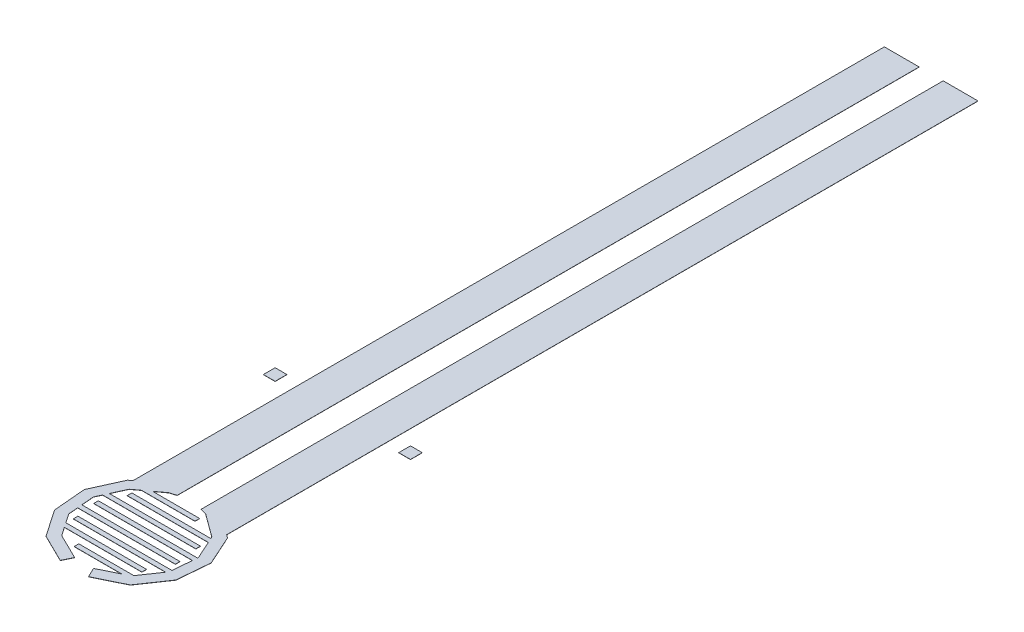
ISO-10303-21;
HEADER;
FILE_DESCRIPTION(('STEP AP214'),'2;1');
FILE_NAME('part.step','',(''),(''),'','','');
FILE_SCHEMA(('AUTOMOTIVE_DESIGN { 1 0 10303 214 1 1 1 1 }'));
ENDSEC;
DATA;
#1=APPLICATION_CONTEXT('core data for automotive mechanical design processes');
#2=APPLICATION_PROTOCOL_DEFINITION('international standard','automotive_design',2000,#1);
#3=PRODUCT_CONTEXT('',#1,'mechanical');
#4=PRODUCT('Part','Part','',(#3));
#5=PRODUCT_RELATED_PRODUCT_CATEGORY('part','',(#4));
#6=PRODUCT_DEFINITION_FORMATION('','',#4);
#7=PRODUCT_DEFINITION_CONTEXT('part definition',#1,'design');
#8=PRODUCT_DEFINITION('design','',#6,#7);
#9=PRODUCT_DEFINITION_SHAPE('','',#8);
#10=(LENGTH_UNIT() NAMED_UNIT(*) SI_UNIT(.MILLI.,.METRE.));
#11=(NAMED_UNIT(*) PLANE_ANGLE_UNIT() SI_UNIT($,.RADIAN.));
#12=(NAMED_UNIT(*) SI_UNIT($,.STERADIAN.) SOLID_ANGLE_UNIT());
#13=UNCERTAINTY_MEASURE_WITH_UNIT(LENGTH_MEASURE(1.E-05),#10,'distance_accuracy_value','');
#14=(GEOMETRIC_REPRESENTATION_CONTEXT(3) GLOBAL_UNCERTAINTY_ASSIGNED_CONTEXT((#13)) GLOBAL_UNIT_ASSIGNED_CONTEXT((#10,
#11,#12)) REPRESENTATION_CONTEXT('',''));
#15=CARTESIAN_POINT('',(0.,0.,0.));
#16=DIRECTION('',(0.,0.,1.));
#17=DIRECTION('',(1.,0.,0.));
#18=AXIS2_PLACEMENT_3D('',#15,#16,#17);
#19=CARTESIAN_POINT('',(-0.487961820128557,0.007,-34.2863208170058));
#20=DIRECTION('',(-1.,0.,0.));
#21=DIRECTION('',(0.,0.,1.));
#22=AXIS2_PLACEMENT_3D('',#19,#20,#21);
#23=PLANE('',#22);
#24=DIRECTION('',(0.,0.,-1.));
#25=VECTOR('',#24,1.);
#26=CARTESIAN_POINT('',(-0.487961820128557,0.,-34.2863208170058));
#27=LINE('',#26,#25);
#28=CARTESIAN_POINT('',(-0.487961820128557,0.,-2.25432081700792));
#29=VERTEX_POINT('',#28);
#30=CARTESIAN_POINT('',(-0.487961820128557,0.,-34.2863208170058));
#31=VERTEX_POINT('',#30);
#32=EDGE_CURVE('E275',#29,#31,#27,.T.);
#33=ORIENTED_EDGE('',*,*,#32,.T.);
#34=DIRECTION('',(0.,-1.,0.));
#35=VECTOR('',#34,1.);
#36=CARTESIAN_POINT('',(-0.487961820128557,0.007,-34.2863208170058));
#37=LINE('',#36,#35);
#38=CARTESIAN_POINT('',(-0.487961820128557,0.007,-34.2863208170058));
#39=VERTEX_POINT('',#38);
#40=EDGE_CURVE('E12',#39,#31,#37,.T.);
#41=ORIENTED_EDGE('',*,*,#40,.F.);
#42=DIRECTION('',(0.,0.,-1.));
#43=VECTOR('',#42,1.);
#44=CARTESIAN_POINT('',(-0.487961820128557,0.007,-34.2863208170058));
#45=LINE('',#44,#43);
#46=CARTESIAN_POINT('',(-0.487961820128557,0.007,-2.25432081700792));
#47=VERTEX_POINT('',#46);
#48=EDGE_CURVE('E335',#47,#39,#45,.T.);
#49=ORIENTED_EDGE('',*,*,#48,.F.);
#50=DIRECTION('',(0.,-1.,0.));
#51=VECTOR('',#50,1.);
#52=CARTESIAN_POINT('',(-0.487961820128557,0.007,-2.25432081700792));
#53=LINE('',#52,#51);
#54=EDGE_CURVE('E271',#47,#29,#53,.T.);
#55=ORIENTED_EDGE('',*,*,#54,.T.);
#56=EDGE_LOOP('',(#33,#41,#49,#55));
#57=FACE_BOUND('',#56,.T.);
#58=ADVANCED_FACE('F41',(#57),#23,.F.);
#59=CARTESIAN_POINT('',(-0.487961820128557,0.007,-34.2863208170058));
#60=DIRECTION('',(0.,0.,1.));
#61=DIRECTION('',(1.,0.,0.));
#62=AXIS2_PLACEMENT_3D('',#59,#60,#61);
#63=PLANE('',#62);
#64=DIRECTION('',(-1.,0.,0.));
#65=VECTOR('',#64,1.);
#66=CARTESIAN_POINT('',(-0.487961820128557,0.,-34.2863208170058));
#67=LINE('',#66,#65);
#68=CARTESIAN_POINT('',(-1.98996182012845,0.,-34.2863208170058));
#69=VERTEX_POINT('',#68);
#70=EDGE_CURVE('E278',#31,#69,#67,.T.);
#71=ORIENTED_EDGE('',*,*,#70,.T.);
#72=DIRECTION('',(0.,-1.,0.));
#73=VECTOR('',#72,1.);
#74=CARTESIAN_POINT('',(-1.98996182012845,0.007,-34.2863208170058));
#75=LINE('',#74,#73);
#76=CARTESIAN_POINT('',(-1.98996182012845,0.007,-34.2863208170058));
#77=VERTEX_POINT('',#76);
#78=EDGE_CURVE('E49',#77,#69,#75,.T.);
#79=ORIENTED_EDGE('',*,*,#78,.F.);
#80=DIRECTION('',(-1.,0.,0.));
#81=VECTOR('',#80,1.);
#82=CARTESIAN_POINT('',(-0.487961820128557,0.007,-34.2863208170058));
#83=LINE('',#82,#81);
#84=EDGE_CURVE('E169',#39,#77,#83,.T.);
#85=ORIENTED_EDGE('',*,*,#84,.F.);
#86=ORIENTED_EDGE('',*,*,#40,.T.);
#87=EDGE_LOOP('',(#71,#79,#85,#86));
#88=FACE_BOUND('',#87,.T.);
#89=ADVANCED_FACE('F508',(#88),#63,.F.);
#90=CARTESIAN_POINT('',(-1.98996182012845,0.007,-34.2863208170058));
#91=DIRECTION('',(1.,0.,0.));
#92=DIRECTION('',(0.,0.,-1.));
#93=AXIS2_PLACEMENT_3D('',#90,#91,#92);
#94=PLANE('',#93);
#95=DIRECTION('',(0.,0.,1.));
#96=VECTOR('',#95,1.);
#97=CARTESIAN_POINT('',(-1.98996182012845,0.,-34.2863208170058));
#98=LINE('',#97,#96);
#99=CARTESIAN_POINT('',(-1.98996182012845,0.,-1.84992801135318));
#100=VERTEX_POINT('',#99);
#101=EDGE_CURVE('E280',#69,#100,#98,.T.);
#102=ORIENTED_EDGE('',*,*,#101,.T.);
#103=DIRECTION('',(0.,-1.,0.));
#104=VECTOR('',#103,1.);
#105=CARTESIAN_POINT('',(-1.98996182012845,0.007,-1.84992801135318));
#106=LINE('',#105,#104);
#107=CARTESIAN_POINT('',(-1.98996182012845,0.007,-1.84992801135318));
#108=VERTEX_POINT('',#107);
#109=EDGE_CURVE('E411',#108,#100,#106,.T.);
#110=ORIENTED_EDGE('',*,*,#109,.F.);
#111=DIRECTION('',(0.,0.,1.));
#112=VECTOR('',#111,1.);
#113=CARTESIAN_POINT('',(-1.98996182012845,0.007,-34.2863208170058));
#114=LINE('',#113,#112);
#115=EDGE_CURVE('E419',#77,#108,#114,.T.);
#116=ORIENTED_EDGE('',*,*,#115,.F.);
#117=ORIENTED_EDGE('',*,*,#78,.T.);
#118=EDGE_LOOP('',(#102,#110,#116,#117));
#119=FACE_BOUND('',#118,.T.);
#120=ADVANCED_FACE('F417',(#119),#94,.F.);
#121=CARTESIAN_POINT('',(-1.98996182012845,0.007,-1.84992801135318));
#122=DIRECTION('',(0.590423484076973,0.,0.80709361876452));
#123=DIRECTION('',(0.80709361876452,0.,-0.590423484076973));
#124=AXIS2_PLACEMENT_3D('',#121,#122,#123);
#125=PLANE('',#124);
#126=DIRECTION('',(-0.80709361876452,0.,0.590423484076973));
#127=VECTOR('',#126,1.);
#128=CARTESIAN_POINT('',(-1.98996182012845,0.,-1.84992801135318));
#129=LINE('',#128,#127);
#130=CARTESIAN_POINT('',(-2.12712633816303,0.,-1.74958630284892));
#131=VERTEX_POINT('',#130);
#132=EDGE_CURVE('E282',#100,#131,#129,.T.);
#133=ORIENTED_EDGE('',*,*,#132,.T.);
#134=DIRECTION('',(0.,-1.,0.));
#135=VECTOR('',#134,1.);
#136=CARTESIAN_POINT('',(-2.12712633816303,0.007,-1.74958630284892));
#137=LINE('',#136,#135);
#138=CARTESIAN_POINT('',(-2.12712633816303,0.007,-1.74958630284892));
#139=VERTEX_POINT('',#138);
#140=EDGE_CURVE('E408',#139,#131,#137,.T.);
#141=ORIENTED_EDGE('',*,*,#140,.F.);
#142=DIRECTION('',(-0.80709361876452,0.,0.590423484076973));
#143=VECTOR('',#142,1.);
#144=CARTESIAN_POINT('',(-1.98996182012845,0.007,-1.84992801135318));
#145=LINE('',#144,#143);
#146=EDGE_CURVE('E437',#108,#139,#145,.T.);
#147=ORIENTED_EDGE('',*,*,#146,.F.);
#148=ORIENTED_EDGE('',*,*,#109,.T.);
#149=EDGE_LOOP('',(#133,#141,#147,#148));
#150=FACE_BOUND('',#149,.T.);
#151=ADVANCED_FACE('F428',(#150),#125,.F.);
#152=CARTESIAN_POINT('',(-2.12712633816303,0.007,-1.74958630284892));
#153=DIRECTION('',(0.910844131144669,0.,0.412750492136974));
#154=DIRECTION('',(0.412750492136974,0.,-0.910844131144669));
#155=AXIS2_PLACEMENT_3D('',#152,#153,#154);
#156=PLANE('',#155);
#157=DIRECTION('',(-0.412750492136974,0.,0.910844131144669));
#158=VECTOR('',#157,1.);
#159=CARTESIAN_POINT('',(-2.12712633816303,0.,-1.74958630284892));
#160=LINE('',#159,#158);
#161=CARTESIAN_POINT('',(-2.70936796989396,0.,-0.464714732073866));
#162=VERTEX_POINT('',#161);
#163=EDGE_CURVE('E284',#131,#162,#160,.T.);
#164=ORIENTED_EDGE('',*,*,#163,.T.);
#165=DIRECTION('',(0.,-1.,0.));
#166=VECTOR('',#165,1.);
#167=CARTESIAN_POINT('',(-2.70936796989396,0.007,-0.464714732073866));
#168=LINE('',#167,#166);
#169=CARTESIAN_POINT('',(-2.70936796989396,0.007,-0.464714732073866));
#170=VERTEX_POINT('',#169);
#171=EDGE_CURVE('E405',#170,#162,#168,.T.);
#172=ORIENTED_EDGE('',*,*,#171,.F.);
#173=DIRECTION('',(-0.412750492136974,0.,0.910844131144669));
#174=VECTOR('',#173,1.);
#175=CARTESIAN_POINT('',(-2.12712633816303,0.007,-1.74958630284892));
#176=LINE('',#175,#174);
#177=EDGE_CURVE('E434',#139,#170,#176,.T.);
#178=ORIENTED_EDGE('',*,*,#177,.F.);
#179=ORIENTED_EDGE('',*,*,#140,.T.);
#180=EDGE_LOOP('',(#164,#172,#178,#179));
#181=FACE_BOUND('',#180,.T.);
#182=ADVANCED_FACE('F432',(#181),#156,.F.);
#183=CARTESIAN_POINT('',(-2.70936796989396,0.007,-0.464714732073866));
#184=DIRECTION('',(0.996217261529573,0.,-0.0868974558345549));
#185=DIRECTION('',(-0.0868974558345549,0.,-0.996217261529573));
#186=AXIS2_PLACEMENT_3D('',#183,#184,#185);
#187=PLANE('',#186);
#188=DIRECTION('',(0.0868974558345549,0.,0.996217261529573));
#189=VECTOR('',#188,1.);
#190=CARTESIAN_POINT('',(-2.70936796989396,0.,-0.464714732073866));
#191=LINE('',#190,#189);
#192=CARTESIAN_POINT('',(-2.58680270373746,0.,0.940408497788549));
#193=VERTEX_POINT('',#192);
#194=EDGE_CURVE('E286',#162,#193,#191,.T.);
#195=ORIENTED_EDGE('',*,*,#194,.T.);
#196=DIRECTION('',(0.,-1.,0.));
#197=VECTOR('',#196,1.);
#198=CARTESIAN_POINT('',(-2.58680270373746,0.007,0.940408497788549));
#199=LINE('',#198,#197);
#200=CARTESIAN_POINT('',(-2.58680270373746,0.007,0.940408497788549));
#201=VERTEX_POINT('',#200);
#202=EDGE_CURVE('E402',#201,#193,#199,.T.);
#203=ORIENTED_EDGE('',*,*,#202,.F.);
#204=DIRECTION('',(0.0868974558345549,0.,0.996217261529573));
#205=VECTOR('',#204,1.);
#206=CARTESIAN_POINT('',(-2.70936796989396,0.007,-0.464714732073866));
#207=LINE('',#206,#205);
#208=EDGE_CURVE('E436',#170,#201,#207,.T.);
#209=ORIENTED_EDGE('',*,*,#208,.F.);
#210=ORIENTED_EDGE('',*,*,#171,.T.);
#211=EDGE_LOOP('',(#195,#203,#209,#210));
#212=FACE_BOUND('',#211,.T.);
#213=ADVANCED_FACE('F521',(#212),#187,.F.);
#214=CARTESIAN_POINT('',(-2.58680270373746,0.007,0.940408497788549));
#215=DIRECTION('',(0.825554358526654,0.,-0.564322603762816));
#216=DIRECTION('',(-0.564322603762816,0.,-0.825554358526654));
#217=AXIS2_PLACEMENT_3D('',#214,#215,#216);
#218=PLANE('',#217);
#219=DIRECTION('',(0.564322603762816,0.,0.825554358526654));
#220=VECTOR('',#219,1.);
#221=CARTESIAN_POINT('',(-2.58680270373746,0.,0.940408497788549));
#222=LINE('',#221,#220);
#223=CARTESIAN_POINT('',(-1.79003496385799,0.,2.10600965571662));
#224=VERTEX_POINT('',#223);
#225=EDGE_CURVE('E288',#193,#224,#222,.T.);
#226=ORIENTED_EDGE('',*,*,#225,.T.);
#227=DIRECTION('',(0.,-1.,0.));
#228=VECTOR('',#227,1.);
#229=CARTESIAN_POINT('',(-1.79003496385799,0.007,2.10600965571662));
#230=LINE('',#229,#228);
#231=CARTESIAN_POINT('',(-1.79003496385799,0.007,2.10600965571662));
#232=VERTEX_POINT('',#231);
#233=EDGE_CURVE('E399',#232,#224,#230,.T.);
#234=ORIENTED_EDGE('',*,*,#233,.F.);
#235=DIRECTION('',(0.564322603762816,0.,0.825554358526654));
#236=VECTOR('',#235,1.);
#237=CARTESIAN_POINT('',(-2.58680270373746,0.007,0.940408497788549));
#238=LINE('',#237,#236);
#239=EDGE_CURVE('E439',#201,#232,#238,.T.);
#240=ORIENTED_EDGE('',*,*,#239,.F.);
#241=ORIENTED_EDGE('',*,*,#202,.T.);
#242=EDGE_LOOP('',(#226,#234,#240,#241));
#243=FACE_BOUND('',#242,.T.);
#244=ADVANCED_FACE('F524',(#243),#218,.F.);
#245=CARTESIAN_POINT('',(-1.79003496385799,0.007,2.10600965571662));
#246=DIRECTION('',(0.440792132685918,0.,-0.897609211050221));
#247=DIRECTION('',(-0.897609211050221,0.,-0.440792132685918));
#248=AXIS2_PLACEMENT_3D('',#245,#246,#247);
#249=PLANE('',#248);
#250=DIRECTION('',(0.897609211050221,0.,0.440792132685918));
#251=VECTOR('',#250,1.);
#252=CARTESIAN_POINT('',(-1.79003496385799,0.,2.10600965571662));
#253=LINE('',#252,#251);
#254=CARTESIAN_POINT('',(-0.579225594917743,0.,2.70060609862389));
#255=VERTEX_POINT('',#254);
#256=EDGE_CURVE('E290',#224,#255,#253,.T.);
#257=ORIENTED_EDGE('',*,*,#256,.T.);
#258=DIRECTION('',(0.,-1.,0.));
#259=VECTOR('',#258,1.);
#260=CARTESIAN_POINT('',(-0.579225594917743,0.007,2.70060609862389));
#261=LINE('',#260,#259);
#262=CARTESIAN_POINT('',(-0.579225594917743,0.007,2.70060609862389));
#263=VERTEX_POINT('',#262);
#264=EDGE_CURVE('E396',#263,#255,#261,.T.);
#265=ORIENTED_EDGE('',*,*,#264,.F.);
#266=DIRECTION('',(0.897609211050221,0.,0.440792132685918));
#267=VECTOR('',#266,1.);
#268=CARTESIAN_POINT('',(-1.79003496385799,0.007,2.10600965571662));
#269=LINE('',#268,#267);
#270=EDGE_CURVE('E445',#232,#263,#269,.T.);
#271=ORIENTED_EDGE('',*,*,#270,.F.);
#272=ORIENTED_EDGE('',*,*,#233,.T.);
#273=EDGE_LOOP('',(#257,#265,#271,#272));
#274=FACE_BOUND('',#273,.T.);
#275=ADVANCED_FACE('F528',(#274),#249,.F.);
#276=CARTESIAN_POINT('',(-0.374698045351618,0.007,2.28411542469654));
#277=DIRECTION('',(-0.897609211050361,0.,-0.440792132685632));
#278=DIRECTION('',(-0.440792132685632,0.,0.897609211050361));
#279=AXIS2_PLACEMENT_3D('',#276,#277,#278);
#280=PLANE('',#279);
#281=DIRECTION('',(0.440792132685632,0.,-0.897609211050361));
#282=VECTOR('',#281,1.);
#283=CARTESIAN_POINT('',(-0.374698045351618,0.,2.28411542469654));
#284=LINE('',#283,#282);
#285=CARTESIAN_POINT('',(-0.374698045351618,0.,2.28411542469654));
#286=VERTEX_POINT('',#285);
#287=EDGE_CURVE('E292',#255,#286,#284,.T.);
#288=ORIENTED_EDGE('',*,*,#287,.T.);
#289=DIRECTION('',(0.,-1.,0.));
#290=VECTOR('',#289,1.);
#291=CARTESIAN_POINT('',(-0.374698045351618,0.007,2.28411542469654));
#292=LINE('',#291,#290);
#293=CARTESIAN_POINT('',(-0.374698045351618,0.007,2.28411542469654));
#294=VERTEX_POINT('',#293);
#295=EDGE_CURVE('E393',#294,#286,#292,.T.);
#296=ORIENTED_EDGE('',*,*,#295,.F.);
#297=DIRECTION('',(0.440792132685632,0.,-0.897609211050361));
#298=VECTOR('',#297,1.);
#299=CARTESIAN_POINT('',(-0.374698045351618,0.007,2.28411542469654));
#300=LINE('',#299,#298);
#301=EDGE_CURVE('E447',#263,#294,#300,.T.);
#302=ORIENTED_EDGE('',*,*,#301,.F.);
#303=ORIENTED_EDGE('',*,*,#264,.T.);
#304=EDGE_LOOP('',(#288,#296,#302,#303));
#305=FACE_BOUND('',#304,.T.);
#306=ADVANCED_FACE('F532',(#305),#280,.F.);
#307=CARTESIAN_POINT('',(-1.47589226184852,0.007,1.74334808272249));
#308=DIRECTION('',(-0.440792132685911,0.,0.897609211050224));
#309=DIRECTION('',(0.897609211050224,0.,0.440792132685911));
#310=AXIS2_PLACEMENT_3D('',#307,#308,#309);
#311=PLANE('',#310);
#312=DIRECTION('',(-0.897609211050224,0.,-0.440792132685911));
#313=VECTOR('',#312,1.);
#314=CARTESIAN_POINT('',(-1.47589226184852,0.,1.74334808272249));
#315=LINE('',#314,#313);
#316=CARTESIAN_POINT('',(-1.47589226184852,0.,1.74334808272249));
#317=VERTEX_POINT('',#316);
#318=EDGE_CURVE('E294',#286,#317,#315,.T.);
#319=ORIENTED_EDGE('',*,*,#318,.T.);
#320=DIRECTION('',(0.,-1.,0.));
#321=VECTOR('',#320,1.);
#322=CARTESIAN_POINT('',(-1.47589226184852,0.007,1.74334808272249));
#323=LINE('',#322,#321);
#324=CARTESIAN_POINT('',(-1.47589226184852,0.007,1.74334808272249));
#325=VERTEX_POINT('',#324);
#326=EDGE_CURVE('E390',#325,#317,#323,.T.);
#327=ORIENTED_EDGE('',*,*,#326,.F.);
#328=DIRECTION('',(-0.897609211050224,0.,-0.440792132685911));
#329=VECTOR('',#328,1.);
#330=CARTESIAN_POINT('',(-1.47589226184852,0.007,1.74334808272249));
#331=LINE('',#330,#329);
#332=EDGE_CURVE('E449',#294,#325,#331,.T.);
#333=ORIENTED_EDGE('',*,*,#332,.F.);
#334=ORIENTED_EDGE('',*,*,#295,.T.);
#335=EDGE_LOOP('',(#319,#327,#333,#334));
#336=FACE_BOUND('',#335,.T.);
#337=ADVANCED_FACE('F536',(#336),#311,.F.);
#338=CARTESIAN_POINT('',(-1.72858612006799,0.007,1.37367918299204));
#339=DIRECTION('',(-0.825554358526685,0.,0.564322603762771));
#340=DIRECTION('',(0.564322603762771,0.,0.825554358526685));
#341=AXIS2_PLACEMENT_3D('',#338,#339,#340);
#342=PLANE('',#341);
#343=DIRECTION('',(-0.564322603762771,0.,-0.825554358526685));
#344=VECTOR('',#343,1.);
#345=CARTESIAN_POINT('',(-1.72858612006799,0.,1.37367918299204));
#346=LINE('',#345,#344);
#347=CARTESIAN_POINT('',(-1.72858612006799,0.,1.37367918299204));
#348=VERTEX_POINT('',#347);
#349=EDGE_CURVE('E296',#317,#348,#346,.T.);
#350=ORIENTED_EDGE('',*,*,#349,.T.);
#351=DIRECTION('',(0.,-1.,0.));
#352=VECTOR('',#351,1.);
#353=CARTESIAN_POINT('',(-1.72858612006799,0.007,1.37367918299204));
#354=LINE('',#353,#352);
#355=CARTESIAN_POINT('',(-1.72858612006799,0.007,1.37367918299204));
#356=VERTEX_POINT('',#355);
#357=EDGE_CURVE('E387',#356,#348,#354,.T.);
#358=ORIENTED_EDGE('',*,*,#357,.F.);
#359=DIRECTION('',(-0.564322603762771,0.,-0.825554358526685));
#360=VECTOR('',#359,1.);
#361=CARTESIAN_POINT('',(-1.72858612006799,0.007,1.37367918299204));
#362=LINE('',#361,#360);
#363=EDGE_CURVE('E451',#325,#356,#362,.T.);
#364=ORIENTED_EDGE('',*,*,#363,.F.);
#365=ORIENTED_EDGE('',*,*,#326,.T.);
#366=EDGE_LOOP('',(#350,#358,#364,#365));
#367=FACE_BOUND('',#366,.T.);
#368=ADVANCED_FACE('F540',(#367),#342,.F.);
#369=CARTESIAN_POINT('',(-1.72858612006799,0.007,1.37367918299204));
#370=DIRECTION('',(0.,0.,-1.));
#371=DIRECTION('',(-1.,0.,0.));
#372=AXIS2_PLACEMENT_3D('',#369,#370,#371);
#373=PLANE('',#372);
#374=DIRECTION('',(1.,0.,0.));
#375=VECTOR('',#374,1.);
#376=CARTESIAN_POINT('',(-1.72858612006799,0.,1.37367918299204));
#377=LINE('',#376,#375);
#378=CARTESIAN_POINT('',(1.61726767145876,0.,1.37367918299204));
#379=VERTEX_POINT('',#378);
#380=EDGE_CURVE('E298',#348,#379,#377,.T.);
#381=ORIENTED_EDGE('',*,*,#380,.T.);
#382=DIRECTION('',(0.,-1.,0.));
#383=VECTOR('',#382,1.);
#384=CARTESIAN_POINT('',(1.61726767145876,0.007,1.37367918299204));
#385=LINE('',#384,#383);
#386=CARTESIAN_POINT('',(1.61726767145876,0.007,1.37367918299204));
#387=VERTEX_POINT('',#386);
#388=EDGE_CURVE('E384',#387,#379,#385,.T.);
#389=ORIENTED_EDGE('',*,*,#388,.F.);
#390=DIRECTION('',(1.,0.,0.));
#391=VECTOR('',#390,1.);
#392=CARTESIAN_POINT('',(-1.72858612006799,0.007,1.37367918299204));
#393=LINE('',#392,#391);
#394=EDGE_CURVE('E453',#356,#387,#393,.T.);
#395=ORIENTED_EDGE('',*,*,#394,.F.);
#396=ORIENTED_EDGE('',*,*,#357,.T.);
#397=EDGE_LOOP('',(#381,#389,#395,#396));
#398=FACE_BOUND('',#397,.T.);
#399=ADVANCED_FACE('F544',(#398),#373,.F.);
#400=CARTESIAN_POINT('',(1.61726767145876,0.007,1.17367918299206));
#401=DIRECTION('',(-1.,0.,0.));
#402=DIRECTION('',(0.,0.,1.));
#403=AXIS2_PLACEMENT_3D('',#400,#401,#402);
#404=PLANE('',#403);
#405=DIRECTION('',(0.,0.,-1.));
#406=VECTOR('',#405,1.);
#407=CARTESIAN_POINT('',(1.61726767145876,0.,1.17367918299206));
#408=LINE('',#407,#406);
#409=CARTESIAN_POINT('',(1.61726767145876,0.,1.17367918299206));
#410=VERTEX_POINT('',#409);
#411=EDGE_CURVE('E300',#379,#410,#408,.T.);
#412=ORIENTED_EDGE('',*,*,#411,.T.);
#413=DIRECTION('',(0.,-1.,0.));
#414=VECTOR('',#413,1.);
#415=CARTESIAN_POINT('',(1.61726767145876,0.007,1.17367918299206));
#416=LINE('',#415,#414);
#417=CARTESIAN_POINT('',(1.61726767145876,0.007,1.17367918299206));
#418=VERTEX_POINT('',#417);
#419=EDGE_CURVE('E381',#418,#410,#416,.T.);
#420=ORIENTED_EDGE('',*,*,#419,.F.);
#421=DIRECTION('',(0.,0.,-1.));
#422=VECTOR('',#421,1.);
#423=CARTESIAN_POINT('',(1.61726767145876,0.007,1.17367918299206));
#424=LINE('',#423,#422);
#425=EDGE_CURVE('E455',#387,#418,#424,.T.);
#426=ORIENTED_EDGE('',*,*,#425,.F.);
#427=ORIENTED_EDGE('',*,*,#388,.T.);
#428=EDGE_LOOP('',(#412,#420,#426,#427));
#429=FACE_BOUND('',#428,.T.);
#430=ADVANCED_FACE('F548',(#429),#404,.F.);
#431=CARTESIAN_POINT('',(-1.86529973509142,0.007,1.17367918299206));
#432=DIRECTION('',(0.,0.,1.));
#433=DIRECTION('',(1.,0.,0.));
#434=AXIS2_PLACEMENT_3D('',#431,#432,#433);
#435=PLANE('',#434);
#436=DIRECTION('',(-1.,0.,0.));
#437=VECTOR('',#436,1.);
#438=CARTESIAN_POINT('',(-1.86529973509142,0.,1.17367918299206));
#439=LINE('',#438,#437);
#440=CARTESIAN_POINT('',(-1.86529973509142,0.,1.17367918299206));
#441=VERTEX_POINT('',#440);
#442=EDGE_CURVE('E302',#410,#441,#439,.T.);
#443=ORIENTED_EDGE('',*,*,#442,.T.);
#444=DIRECTION('',(0.,-1.,0.));
#445=VECTOR('',#444,1.);
#446=CARTESIAN_POINT('',(-1.86529973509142,0.007,1.17367918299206));
#447=LINE('',#446,#445);
#448=CARTESIAN_POINT('',(-1.86529973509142,0.007,1.17367918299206));
#449=VERTEX_POINT('',#448);
#450=EDGE_CURVE('E378',#449,#441,#447,.T.);
#451=ORIENTED_EDGE('',*,*,#450,.F.);
#452=DIRECTION('',(-1.,0.,0.));
#453=VECTOR('',#452,1.);
#454=CARTESIAN_POINT('',(-1.86529973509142,0.007,1.17367918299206));
#455=LINE('',#454,#453);
#456=EDGE_CURVE('E457',#418,#449,#455,.T.);
#457=ORIENTED_EDGE('',*,*,#456,.F.);
#458=ORIENTED_EDGE('',*,*,#419,.T.);
#459=EDGE_LOOP('',(#443,#451,#457,#458));
#460=FACE_BOUND('',#459,.T.);
#461=ADVANCED_FACE('F552',(#460),#435,.F.);
#462=CARTESIAN_POINT('',(-2.13512452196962,0.007,0.778949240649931));
#463=DIRECTION('',(-0.825554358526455,0.,0.564322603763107));
#464=DIRECTION('',(0.564322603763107,0.,0.825554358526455));
#465=AXIS2_PLACEMENT_3D('',#462,#463,#464);
#466=PLANE('',#465);
#467=DIRECTION('',(-0.564322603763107,0.,-0.825554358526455));
#468=VECTOR('',#467,1.);
#469=CARTESIAN_POINT('',(-2.13512452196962,0.,0.778949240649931));
#470=LINE('',#469,#468);
#471=CARTESIAN_POINT('',(-2.13512452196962,0.,0.778949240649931));
#472=VERTEX_POINT('',#471);
#473=EDGE_CURVE('E304',#441,#472,#470,.T.);
#474=ORIENTED_EDGE('',*,*,#473,.T.);
#475=DIRECTION('',(0.,-1.,0.));
#476=VECTOR('',#475,1.);
#477=CARTESIAN_POINT('',(-2.13512452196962,0.007,0.778949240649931));
#478=LINE('',#477,#476);
#479=CARTESIAN_POINT('',(-2.13512452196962,0.007,0.778949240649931));
#480=VERTEX_POINT('',#479);
#481=EDGE_CURVE('E375',#480,#472,#478,.T.);
#482=ORIENTED_EDGE('',*,*,#481,.F.);
#483=DIRECTION('',(-0.564322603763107,0.,-0.825554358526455));
#484=VECTOR('',#483,1.);
#485=CARTESIAN_POINT('',(-2.13512452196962,0.007,0.778949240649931));
#486=LINE('',#485,#484);
#487=EDGE_CURVE('E459',#449,#480,#486,.T.);
#488=ORIENTED_EDGE('',*,*,#487,.F.);
#489=ORIENTED_EDGE('',*,*,#450,.T.);
#490=EDGE_LOOP('',(#474,#482,#488,#489));
#491=FACE_BOUND('',#490,.T.);
#492=ADVANCED_FACE('F556',(#491),#466,.F.);
#493=CARTESIAN_POINT('',(-2.17187081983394,0.007,0.357679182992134));
#494=DIRECTION('',(-0.996217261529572,0.,0.0868974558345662));
#495=DIRECTION('',(0.0868974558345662,0.,0.996217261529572));
#496=AXIS2_PLACEMENT_3D('',#493,#494,#495);
#497=PLANE('',#496);
#498=DIRECTION('',(-0.0868974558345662,0.,-0.996217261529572));
#499=VECTOR('',#498,1.);
#500=CARTESIAN_POINT('',(-2.17187081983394,0.,0.357679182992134));
#501=LINE('',#500,#499);
#502=CARTESIAN_POINT('',(-2.17187081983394,0.,0.357679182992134));
#503=VERTEX_POINT('',#502);
#504=EDGE_CURVE('E306',#472,#503,#501,.T.);
#505=ORIENTED_EDGE('',*,*,#504,.T.);
#506=DIRECTION('',(0.,-1.,0.));
#507=VECTOR('',#506,1.);
#508=CARTESIAN_POINT('',(-2.17187081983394,0.007,0.357679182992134));
#509=LINE('',#508,#507);
#510=CARTESIAN_POINT('',(-2.17187081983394,0.007,0.357679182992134));
#511=VERTEX_POINT('',#510);
#512=EDGE_CURVE('E372',#511,#503,#509,.T.);
#513=ORIENTED_EDGE('',*,*,#512,.F.);
#514=DIRECTION('',(-0.0868974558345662,0.,-0.996217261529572));
#515=VECTOR('',#514,1.);
#516=CARTESIAN_POINT('',(-2.17187081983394,0.007,0.357679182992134));
#517=LINE('',#516,#515);
#518=EDGE_CURVE('E461',#480,#511,#517,.T.);
#519=ORIENTED_EDGE('',*,*,#518,.F.);
#520=ORIENTED_EDGE('',*,*,#481,.T.);
#521=EDGE_LOOP('',(#505,#513,#519,#520));
#522=FACE_BOUND('',#521,.T.);
#523=ADVANCED_FACE('F560',(#522),#497,.F.);
#524=CARTESIAN_POINT('',(-2.17187081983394,0.007,0.357679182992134));
#525=DIRECTION('',(0.,0.,-1.));
#526=DIRECTION('',(-1.,0.,0.));
#527=AXIS2_PLACEMENT_3D('',#524,#525,#526);
#528=PLANE('',#527);
#529=DIRECTION('',(1.,0.,0.));
#530=VECTOR('',#529,1.);
#531=CARTESIAN_POINT('',(-2.17187081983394,0.,0.357679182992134));
#532=LINE('',#531,#530);
#533=CARTESIAN_POINT('',(2.04710067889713,0.,0.357679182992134));
#534=VERTEX_POINT('',#533);
#535=EDGE_CURVE('E308',#503,#534,#532,.T.);
#536=ORIENTED_EDGE('',*,*,#535,.T.);
#537=DIRECTION('',(0.,-1.,0.));
#538=VECTOR('',#537,1.);
#539=CARTESIAN_POINT('',(2.04710067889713,0.007,0.357679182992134));
#540=LINE('',#539,#538);
#541=CARTESIAN_POINT('',(2.04710067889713,0.007,0.357679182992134));
#542=VERTEX_POINT('',#541);
#543=EDGE_CURVE('E369',#542,#534,#540,.T.);
#544=ORIENTED_EDGE('',*,*,#543,.F.);
#545=DIRECTION('',(1.,0.,0.));
#546=VECTOR('',#545,1.);
#547=CARTESIAN_POINT('',(-2.17187081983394,0.007,0.357679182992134));
#548=LINE('',#547,#546);
#549=EDGE_CURVE('E463',#511,#542,#548,.T.);
#550=ORIENTED_EDGE('',*,*,#549,.F.);
#551=ORIENTED_EDGE('',*,*,#512,.T.);
#552=EDGE_LOOP('',(#536,#544,#550,#551));
#553=FACE_BOUND('',#552,.T.);
#554=ADVANCED_FACE('F564',(#553),#528,.F.);
#555=CARTESIAN_POINT('',(2.04710067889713,0.007,0.157679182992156));
#556=DIRECTION('',(-1.,0.,0.));
#557=DIRECTION('',(0.,0.,1.));
#558=AXIS2_PLACEMENT_3D('',#555,#556,#557);
#559=PLANE('',#558);
#560=DIRECTION('',(0.,0.,-1.));
#561=VECTOR('',#560,1.);
#562=CARTESIAN_POINT('',(2.04710067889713,0.,0.157679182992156));
#563=LINE('',#562,#561);
#564=CARTESIAN_POINT('',(2.04710067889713,0.,0.157679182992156));
#565=VERTEX_POINT('',#564);
#566=EDGE_CURVE('E310',#534,#565,#563,.T.);
#567=ORIENTED_EDGE('',*,*,#566,.T.);
#568=DIRECTION('',(0.,-1.,0.));
#569=VECTOR('',#568,1.);
#570=CARTESIAN_POINT('',(2.04710067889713,0.007,0.157679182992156));
#571=LINE('',#570,#569);
#572=CARTESIAN_POINT('',(2.04710067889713,0.007,0.157679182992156));
#573=VERTEX_POINT('',#572);
#574=EDGE_CURVE('E366',#573,#565,#571,.T.);
#575=ORIENTED_EDGE('',*,*,#574,.F.);
#576=DIRECTION('',(0.,0.,-1.));
#577=VECTOR('',#576,1.);
#578=CARTESIAN_POINT('',(2.04710067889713,0.007,0.157679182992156));
#579=LINE('',#578,#577);
#580=EDGE_CURVE('E465',#542,#573,#579,.T.);
#581=ORIENTED_EDGE('',*,*,#580,.F.);
#582=ORIENTED_EDGE('',*,*,#543,.T.);
#583=EDGE_LOOP('',(#567,#575,#581,#582));
#584=FACE_BOUND('',#583,.T.);
#585=ADVANCED_FACE('F568',(#584),#559,.F.);
#586=CARTESIAN_POINT('',(-2.18931630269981,0.007,0.157679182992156));
#587=DIRECTION('',(0.,0.,1.));
#588=DIRECTION('',(1.,0.,0.));
#589=AXIS2_PLACEMENT_3D('',#586,#587,#588);
#590=PLANE('',#589);
#591=DIRECTION('',(-1.,0.,0.));
#592=VECTOR('',#591,1.);
#593=CARTESIAN_POINT('',(-2.18931630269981,0.,0.157679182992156));
#594=LINE('',#593,#592);
#595=CARTESIAN_POINT('',(-2.18931630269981,0.,0.157679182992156));
#596=VERTEX_POINT('',#595);
#597=EDGE_CURVE('E312',#565,#596,#594,.T.);
#598=ORIENTED_EDGE('',*,*,#597,.T.);
#599=DIRECTION('',(0.,-1.,0.));
#600=VECTOR('',#599,1.);
#601=CARTESIAN_POINT('',(-2.18931630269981,0.007,0.157679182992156));
#602=LINE('',#601,#600);
#603=CARTESIAN_POINT('',(-2.18931630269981,0.007,0.157679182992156));
#604=VERTEX_POINT('',#603);
#605=EDGE_CURVE('E363',#604,#596,#602,.T.);
#606=ORIENTED_EDGE('',*,*,#605,.F.);
#607=DIRECTION('',(-1.,0.,0.));
#608=VECTOR('',#607,1.);
#609=CARTESIAN_POINT('',(-2.18931630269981,0.007,0.157679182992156));
#610=LINE('',#609,#608);
#611=EDGE_CURVE('E467',#573,#604,#610,.T.);
#612=ORIENTED_EDGE('',*,*,#611,.F.);
#613=ORIENTED_EDGE('',*,*,#574,.T.);
#614=EDGE_LOOP('',(#598,#606,#612,#613));
#615=FACE_BOUND('',#614,.T.);
#616=ADVANCED_FACE('F572',(#615),#590,.F.);
#617=CARTESIAN_POINT('',(-2.23655925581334,0.007,-0.383927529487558));
#618=DIRECTION('',(-0.996217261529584,0.,0.08689745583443));
#619=DIRECTION('',(0.08689745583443,0.,0.996217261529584));
#620=AXIS2_PLACEMENT_3D('',#617,#618,#619);
#621=PLANE('',#620);
#622=DIRECTION('',(-0.08689745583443,0.,-0.996217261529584));
#623=VECTOR('',#622,1.);
#624=CARTESIAN_POINT('',(-2.23655925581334,0.,-0.383927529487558));
#625=LINE('',#624,#623);
#626=CARTESIAN_POINT('',(-2.23655925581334,0.,-0.383927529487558));
#627=VERTEX_POINT('',#626);
#628=EDGE_CURVE('E314',#596,#627,#625,.T.);
#629=ORIENTED_EDGE('',*,*,#628,.T.);
#630=DIRECTION('',(0.,-1.,0.));
#631=VECTOR('',#630,1.);
#632=CARTESIAN_POINT('',(-2.23655925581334,0.007,-0.383927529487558));
#633=LINE('',#632,#631);
#634=CARTESIAN_POINT('',(-2.23655925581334,0.007,-0.383927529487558));
#635=VERTEX_POINT('',#634);
#636=EDGE_CURVE('E360',#635,#627,#633,.T.);
#637=ORIENTED_EDGE('',*,*,#636,.F.);
#638=DIRECTION('',(-0.08689745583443,0.,-0.996217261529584));
#639=VECTOR('',#638,1.);
#640=CARTESIAN_POINT('',(-2.23655925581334,0.007,-0.383927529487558));
#641=LINE('',#640,#639);
#642=EDGE_CURVE('E469',#604,#635,#641,.T.);
#643=ORIENTED_EDGE('',*,*,#642,.F.);
#644=ORIENTED_EDGE('',*,*,#605,.T.);
#645=EDGE_LOOP('',(#629,#637,#643,#644));
#646=FACE_BOUND('',#645,.T.);
#647=ADVANCED_FACE('F576',(#646),#621,.F.);
#648=CARTESIAN_POINT('',(-2.11221749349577,0.007,-0.658320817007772));
#649=DIRECTION('',(-0.91084413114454,0.,-0.412750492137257));
#650=DIRECTION('',(-0.412750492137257,0.,0.91084413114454));
#651=AXIS2_PLACEMENT_3D('',#648,#649,#650);
#652=PLANE('',#651);
#653=DIRECTION('',(0.412750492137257,0.,-0.91084413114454));
#654=VECTOR('',#653,1.);
#655=CARTESIAN_POINT('',(-2.11221749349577,0.,-0.658320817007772));
#656=LINE('',#655,#654);
#657=CARTESIAN_POINT('',(-2.11221749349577,0.,-0.658320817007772));
#658=VERTEX_POINT('',#657);
#659=EDGE_CURVE('E316',#627,#658,#656,.T.);
#660=ORIENTED_EDGE('',*,*,#659,.T.);
#661=DIRECTION('',(0.,-1.,0.));
#662=VECTOR('',#661,1.);
#663=CARTESIAN_POINT('',(-2.11221749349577,0.007,-0.658320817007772));
#664=LINE('',#663,#662);
#665=CARTESIAN_POINT('',(-2.11221749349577,0.007,-0.658320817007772));
#666=VERTEX_POINT('',#665);
#667=EDGE_CURVE('E357',#666,#658,#664,.T.);
#668=ORIENTED_EDGE('',*,*,#667,.F.);
#669=DIRECTION('',(0.412750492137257,0.,-0.91084413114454));
#670=VECTOR('',#669,1.);
#671=CARTESIAN_POINT('',(-2.11221749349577,0.007,-0.658320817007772));
#672=LINE('',#671,#670);
#673=EDGE_CURVE('E471',#635,#666,#672,.T.);
#674=ORIENTED_EDGE('',*,*,#673,.F.);
#675=ORIENTED_EDGE('',*,*,#636,.T.);
#676=EDGE_LOOP('',(#660,#668,#674,#675));
#677=FACE_BOUND('',#676,.T.);
#678=ADVANCED_FACE('F580',(#677),#652,.F.);
#679=CARTESIAN_POINT('',(-2.11221749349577,0.007,-0.658320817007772));
#680=DIRECTION('',(0.,0.,-1.));
#681=DIRECTION('',(-1.,0.,0.));
#682=AXIS2_PLACEMENT_3D('',#679,#680,#681);
#683=PLANE('',#682);
#684=DIRECTION('',(1.,0.,0.));
#685=VECTOR('',#684,1.);
#686=CARTESIAN_POINT('',(-2.11221749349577,0.,-0.658320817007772));
#687=LINE('',#686,#685);
#688=CARTESIAN_POINT('',(1.91475259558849,0.,-0.658320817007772));
#689=VERTEX_POINT('',#688);
#690=EDGE_CURVE('E318',#658,#689,#687,.T.);
#691=ORIENTED_EDGE('',*,*,#690,.T.);
#692=DIRECTION('',(0.,-1.,0.));
#693=VECTOR('',#692,1.);
#694=CARTESIAN_POINT('',(1.91475259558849,0.007,-0.658320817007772));
#695=LINE('',#694,#693);
#696=CARTESIAN_POINT('',(1.91475259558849,0.007,-0.658320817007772));
#697=VERTEX_POINT('',#696);
#698=EDGE_CURVE('E354',#697,#689,#695,.T.);
#699=ORIENTED_EDGE('',*,*,#698,.F.);
#700=DIRECTION('',(1.,0.,0.));
#701=VECTOR('',#700,1.);
#702=CARTESIAN_POINT('',(-2.11221749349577,0.007,-0.658320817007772));
#703=LINE('',#702,#701);
#704=EDGE_CURVE('E473',#666,#697,#703,.T.);
#705=ORIENTED_EDGE('',*,*,#704,.F.);
#706=ORIENTED_EDGE('',*,*,#667,.T.);
#707=EDGE_LOOP('',(#691,#699,#705,#706));
#708=FACE_BOUND('',#707,.T.);
#709=ADVANCED_FACE('F584',(#708),#683,.F.);
#710=CARTESIAN_POINT('',(1.91475259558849,0.007,-0.85832081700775));
#711=DIRECTION('',(-1.,0.,0.));
#712=DIRECTION('',(0.,0.,1.));
#713=AXIS2_PLACEMENT_3D('',#710,#711,#712);
#714=PLANE('',#713);
#715=DIRECTION('',(0.,0.,-1.));
#716=VECTOR('',#715,1.);
#717=CARTESIAN_POINT('',(1.91475259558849,0.,-0.85832081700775));
#718=LINE('',#717,#716);
#719=CARTESIAN_POINT('',(1.91475259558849,0.,-0.85832081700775));
#720=VERTEX_POINT('',#719);
#721=EDGE_CURVE('E320',#689,#720,#718,.T.);
#722=ORIENTED_EDGE('',*,*,#721,.T.);
#723=DIRECTION('',(0.,-1.,0.));
#724=VECTOR('',#723,1.);
#725=CARTESIAN_POINT('',(1.91475259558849,0.007,-0.85832081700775));
#726=LINE('',#725,#724);
#727=CARTESIAN_POINT('',(1.91475259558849,0.007,-0.85832081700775));
#728=VERTEX_POINT('',#727);
#729=EDGE_CURVE('E351',#728,#720,#726,.T.);
#730=ORIENTED_EDGE('',*,*,#729,.F.);
#731=DIRECTION('',(0.,0.,-1.));
#732=VECTOR('',#731,1.);
#733=CARTESIAN_POINT('',(1.91475259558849,0.007,-0.85832081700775));
#734=LINE('',#733,#732);
#735=EDGE_CURVE('E475',#697,#728,#734,.T.);
#736=ORIENTED_EDGE('',*,*,#735,.F.);
#737=ORIENTED_EDGE('',*,*,#698,.T.);
#738=EDGE_LOOP('',(#722,#730,#736,#737));
#739=FACE_BOUND('',#738,.T.);
#740=ADVANCED_FACE('F588',(#739),#714,.F.);
#741=CARTESIAN_POINT('',(-2.02158716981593,0.007,-0.85832081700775));
#742=DIRECTION('',(0.,0.,1.));
#743=DIRECTION('',(1.,0.,0.));
#744=AXIS2_PLACEMENT_3D('',#741,#742,#743);
#745=PLANE('',#744);
#746=DIRECTION('',(-1.,0.,0.));
#747=VECTOR('',#746,1.);
#748=CARTESIAN_POINT('',(-2.02158716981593,0.,-0.85832081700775));
#749=LINE('',#748,#747);
#750=CARTESIAN_POINT('',(-2.02158716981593,0.,-0.85832081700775));
#751=VERTEX_POINT('',#750);
#752=EDGE_CURVE('E322',#720,#751,#749,.T.);
#753=ORIENTED_EDGE('',*,*,#752,.T.);
#754=DIRECTION('',(0.,-1.,0.));
#755=VECTOR('',#754,1.);
#756=CARTESIAN_POINT('',(-2.02158716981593,0.007,-0.85832081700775));
#757=LINE('',#756,#755);
#758=CARTESIAN_POINT('',(-2.02158716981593,0.007,-0.85832081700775));
#759=VERTEX_POINT('',#758);
#760=EDGE_CURVE('E348',#759,#751,#757,.T.);
#761=ORIENTED_EDGE('',*,*,#760,.F.);
#762=DIRECTION('',(-1.,0.,0.));
#763=VECTOR('',#762,1.);
#764=CARTESIAN_POINT('',(-2.02158716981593,0.007,-0.85832081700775));
#765=LINE('',#764,#763);
#766=EDGE_CURVE('E477',#728,#759,#765,.T.);
#767=ORIENTED_EDGE('',*,*,#766,.F.);
#768=ORIENTED_EDGE('',*,*,#729,.T.);
#769=EDGE_LOOP('',(#753,#761,#767,#768));
#770=FACE_BOUND('',#769,.T.);
#771=ADVANCED_FACE('F592',(#770),#745,.F.);
#772=CARTESIAN_POINT('',(-1.75480088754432,0.007,-1.44705595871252));
#773=DIRECTION('',(-0.910844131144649,0.,-0.412750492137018));
#774=DIRECTION('',(-0.412750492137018,0.,0.910844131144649));
#775=AXIS2_PLACEMENT_3D('',#772,#773,#774);
#776=PLANE('',#775);
#777=DIRECTION('',(0.412750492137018,0.,-0.910844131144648));
#778=VECTOR('',#777,1.);
#779=CARTESIAN_POINT('',(-1.75480088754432,0.,-1.44705595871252));
#780=LINE('',#779,#778);
#781=CARTESIAN_POINT('',(-1.75480088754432,0.,-1.44705595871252));
#782=VERTEX_POINT('',#781);
#783=EDGE_CURVE('E324',#751,#782,#780,.T.);
#784=ORIENTED_EDGE('',*,*,#783,.T.);
#785=DIRECTION('',(0.,-1.,0.));
#786=VECTOR('',#785,1.);
#787=CARTESIAN_POINT('',(-1.75480088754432,0.007,-1.44705595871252));
#788=LINE('',#787,#786);
#789=CARTESIAN_POINT('',(-1.75480088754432,0.007,-1.44705595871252));
#790=VERTEX_POINT('',#789);
#791=EDGE_CURVE('E345',#790,#782,#788,.T.);
#792=ORIENTED_EDGE('',*,*,#791,.F.);
#793=DIRECTION('',(0.412750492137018,0.,-0.910844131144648));
#794=VECTOR('',#793,1.);
#795=CARTESIAN_POINT('',(-1.75480088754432,0.007,-1.44705595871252));
#796=LINE('',#795,#794);
#797=EDGE_CURVE('E479',#759,#790,#796,.T.);
#798=ORIENTED_EDGE('',*,*,#797,.F.);
#799=ORIENTED_EDGE('',*,*,#760,.T.);
#800=EDGE_LOOP('',(#784,#792,#798,#799));
#801=FACE_BOUND('',#800,.T.);
#802=ADVANCED_FACE('F596',(#801),#776,.F.);
#803=CARTESIAN_POINT('',(-1.44413570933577,0.007,-1.6743208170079));
#804=DIRECTION('',(-0.590423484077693,0.,-0.807093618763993));
#805=DIRECTION('',(-0.807093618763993,0.,0.590423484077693));
#806=AXIS2_PLACEMENT_3D('',#803,#804,#805);
#807=PLANE('',#806);
#808=DIRECTION('',(0.807093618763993,0.,-0.590423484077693));
#809=VECTOR('',#808,1.);
#810=CARTESIAN_POINT('',(-1.44413570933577,0.,-1.6743208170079));
#811=LINE('',#810,#809);
#812=CARTESIAN_POINT('',(-1.44413570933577,0.,-1.6743208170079));
#813=VERTEX_POINT('',#812);
#814=EDGE_CURVE('E326',#782,#813,#811,.T.);
#815=ORIENTED_EDGE('',*,*,#814,.T.);
#816=DIRECTION('',(0.,-1.,0.));
#817=VECTOR('',#816,1.);
#818=CARTESIAN_POINT('',(-1.44413570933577,0.007,-1.6743208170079));
#819=LINE('',#818,#817);
#820=CARTESIAN_POINT('',(-1.44413570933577,0.007,-1.6743208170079));
#821=VERTEX_POINT('',#820);
#822=EDGE_CURVE('E342',#821,#813,#819,.T.);
#823=ORIENTED_EDGE('',*,*,#822,.F.);
#824=DIRECTION('',(0.807093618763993,0.,-0.590423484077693));
#825=VECTOR('',#824,1.);
#826=CARTESIAN_POINT('',(-1.44413570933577,0.007,-1.6743208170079));
#827=LINE('',#826,#825);
#828=EDGE_CURVE('E481',#790,#821,#827,.T.);
#829=ORIENTED_EDGE('',*,*,#828,.F.);
#830=ORIENTED_EDGE('',*,*,#791,.T.);
#831=EDGE_LOOP('',(#815,#823,#829,#830));
#832=FACE_BOUND('',#831,.T.);
#833=ADVANCED_FACE('F600',(#832),#807,.F.);
#834=CARTESIAN_POINT('',(-1.44413570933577,0.007,-1.6743208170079));
#835=DIRECTION('',(0.,0.,-1.));
#836=DIRECTION('',(-1.,0.,0.));
#837=AXIS2_PLACEMENT_3D('',#834,#835,#836);
#838=PLANE('',#837);
#839=DIRECTION('',(1.,0.,0.));
#840=VECTOR('',#839,1.);
#841=CARTESIAN_POINT('',(-1.44413570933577,0.,-1.6743208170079));
#842=LINE('',#841,#840);
#843=CARTESIAN_POINT('',(0.862375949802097,0.,-1.6743208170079));
#844=VERTEX_POINT('',#843);
#845=EDGE_CURVE('E328',#813,#844,#842,.T.);
#846=ORIENTED_EDGE('',*,*,#845,.T.);
#847=DIRECTION('',(0.,-1.,0.));
#848=VECTOR('',#847,1.);
#849=CARTESIAN_POINT('',(0.862375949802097,0.007,-1.6743208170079));
#850=LINE('',#849,#848);
#851=CARTESIAN_POINT('',(0.862375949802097,0.007,-1.6743208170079));
#852=VERTEX_POINT('',#851);
#853=EDGE_CURVE('E339',#852,#844,#850,.T.);
#854=ORIENTED_EDGE('',*,*,#853,.F.);
#855=DIRECTION('',(1.,0.,0.));
#856=VECTOR('',#855,1.);
#857=CARTESIAN_POINT('',(-1.44413570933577,0.007,-1.6743208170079));
#858=LINE('',#857,#856);
#859=EDGE_CURVE('E483',#821,#852,#858,.T.);
#860=ORIENTED_EDGE('',*,*,#859,.F.);
#861=ORIENTED_EDGE('',*,*,#822,.T.);
#862=EDGE_LOOP('',(#846,#854,#860,#861));
#863=FACE_BOUND('',#862,.T.);
#864=ADVANCED_FACE('F489',(#863),#838,.F.);
#865=CARTESIAN_POINT('',(0.862375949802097,0.007,-1.87432081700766));
#866=DIRECTION('',(-1.,0.,0.));
#867=DIRECTION('',(0.,0.,1.));
#868=AXIS2_PLACEMENT_3D('',#865,#866,#867);
#869=PLANE('',#868);
#870=DIRECTION('',(0.,0.,-1.));
#871=VECTOR('',#870,1.);
#872=CARTESIAN_POINT('',(0.862375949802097,0.,-1.87432081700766));
#873=LINE('',#872,#871);
#874=CARTESIAN_POINT('',(0.862375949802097,0.,-1.87432081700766));
#875=VERTEX_POINT('',#874);
#876=EDGE_CURVE('E330',#844,#875,#873,.T.);
#877=ORIENTED_EDGE('',*,*,#876,.T.);
#878=DIRECTION('',(0.,-1.,0.));
#879=VECTOR('',#878,1.);
#880=CARTESIAN_POINT('',(0.862375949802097,0.007,-1.87432081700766));
#881=LINE('',#880,#879);
#882=CARTESIAN_POINT('',(0.862375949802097,0.007,-1.87432081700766));
#883=VERTEX_POINT('',#882);
#884=EDGE_CURVE('E266',#883,#875,#881,.T.);
#885=ORIENTED_EDGE('',*,*,#884,.F.);
#886=DIRECTION('',(0.,0.,-1.));
#887=VECTOR('',#886,1.);
#888=CARTESIAN_POINT('',(0.862375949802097,0.007,-1.87432081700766));
#889=LINE('',#888,#887);
#890=EDGE_CURVE('E257',#852,#883,#889,.T.);
#891=ORIENTED_EDGE('',*,*,#890,.F.);
#892=ORIENTED_EDGE('',*,*,#853,.T.);
#893=EDGE_LOOP('',(#877,#885,#891,#892));
#894=FACE_BOUND('',#893,.T.);
#895=ADVANCED_FACE('F493',(#894),#869,.F.);
#896=CARTESIAN_POINT('',(-1.17074088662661,0.007,-1.87432081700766));
#897=DIRECTION('',(0.,0.,1.));
#898=DIRECTION('',(1.,0.,0.));
#899=AXIS2_PLACEMENT_3D('',#896,#897,#898);
#900=PLANE('',#899);
#901=DIRECTION('',(-1.,0.,0.));
#902=VECTOR('',#901,1.);
#903=CARTESIAN_POINT('',(-1.17074088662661,0.,-1.87432081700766));
#904=LINE('',#903,#902);
#905=CARTESIAN_POINT('',(-1.17074088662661,0.,-1.87432081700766));
#906=VERTEX_POINT('',#905);
#907=EDGE_CURVE('E265',#875,#906,#904,.T.);
#908=ORIENTED_EDGE('',*,*,#907,.T.);
#909=DIRECTION('',(0.,-1.,0.));
#910=VECTOR('',#909,1.);
#911=CARTESIAN_POINT('',(-1.17074088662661,0.007,-1.87432081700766));
#912=LINE('',#911,#910);
#913=CARTESIAN_POINT('',(-1.17074088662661,0.007,-1.87432081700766));
#914=VERTEX_POINT('',#913);
#915=EDGE_CURVE('E262',#914,#906,#912,.T.);
#916=ORIENTED_EDGE('',*,*,#915,.F.);
#917=DIRECTION('',(-1.,0.,0.));
#918=VECTOR('',#917,1.);
#919=CARTESIAN_POINT('',(-1.17074088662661,0.007,-1.87432081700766));
#920=LINE('',#919,#918);
#921=EDGE_CURVE('E251',#883,#914,#920,.T.);
#922=ORIENTED_EDGE('',*,*,#921,.F.);
#923=ORIENTED_EDGE('',*,*,#884,.T.);
#924=EDGE_LOOP('',(#908,#916,#922,#923));
#925=FACE_BOUND('',#924,.T.);
#926=ADVANCED_FACE('F263',(#925),#900,.F.);
#927=CARTESIAN_POINT('',(-0.763906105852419,0.007,-2.17193785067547));
#928=DIRECTION('',(-0.590423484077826,0.,-0.807093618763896));
#929=DIRECTION('',(-0.807093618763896,0.,0.590423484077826));
#930=AXIS2_PLACEMENT_3D('',#927,#928,#929);
#931=PLANE('',#930);
#932=DIRECTION('',(0.807093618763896,0.,-0.590423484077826));
#933=VECTOR('',#932,1.);
#934=CARTESIAN_POINT('',(-0.763906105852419,0.,-2.17193785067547));
#935=LINE('',#934,#933);
#936=CARTESIAN_POINT('',(-0.763906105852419,0.,-2.17193785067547));
#937=VERTEX_POINT('',#936);
#938=EDGE_CURVE('E155',#906,#937,#935,.T.);
#939=ORIENTED_EDGE('',*,*,#938,.T.);
#940=DIRECTION('',(0.,-1.,0.));
#941=VECTOR('',#940,1.);
#942=CARTESIAN_POINT('',(-0.763906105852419,0.007,-2.17193785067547));
#943=LINE('',#942,#941);
#944=CARTESIAN_POINT('',(-0.763906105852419,0.007,-2.17193785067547));
#945=VERTEX_POINT('',#944);
#946=EDGE_CURVE('E267',#945,#937,#943,.T.);
#947=ORIENTED_EDGE('',*,*,#946,.F.);
#948=DIRECTION('',(0.807093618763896,0.,-0.590423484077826));
#949=VECTOR('',#948,1.);
#950=CARTESIAN_POINT('',(-0.763906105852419,0.007,-2.17193785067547));
#951=LINE('',#950,#949);
#952=EDGE_CURVE('E255',#914,#945,#951,.T.);
#953=ORIENTED_EDGE('',*,*,#952,.F.);
#954=ORIENTED_EDGE('',*,*,#915,.T.);
#955=EDGE_LOOP('',(#939,#947,#953,#954));
#956=FACE_BOUND('',#955,.T.);
#957=ADVANCED_FACE('F269',(#956),#931,.F.);
#958=CARTESIAN_POINT('',(-0.487961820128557,0.007,-2.25432081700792));
#959=DIRECTION('',(-0.286072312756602,0.,-0.958208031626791));
#960=DIRECTION('',(-0.958208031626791,0.,0.286072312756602));
#961=AXIS2_PLACEMENT_3D('',#958,#959,#960);
#962=PLANE('',#961);
#963=DIRECTION('',(0.958208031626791,0.,-0.286072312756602));
#964=VECTOR('',#963,1.);
#965=CARTESIAN_POINT('',(-0.487961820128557,0.,-2.25432081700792));
#966=LINE('',#965,#964);
#967=EDGE_CURVE('E161',#937,#29,#966,.T.);
#968=ORIENTED_EDGE('',*,*,#967,.T.);
#969=ORIENTED_EDGE('',*,*,#54,.F.);
#970=DIRECTION('',(0.958208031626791,0.,-0.286072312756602));
#971=VECTOR('',#970,1.);
#972=CARTESIAN_POINT('',(-0.487961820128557,0.007,-2.25432081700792));
#973=LINE('',#972,#971);
#974=EDGE_CURVE('E57',#945,#47,#973,.T.);
#975=ORIENTED_EDGE('',*,*,#974,.F.);
#976=ORIENTED_EDGE('',*,*,#946,.T.);
#977=EDGE_LOOP('',(#968,#969,#975,#976));
#978=FACE_BOUND('',#977,.T.);
#979=ADVANCED_FACE('F497',(#978),#962,.F.);
#980=CARTESIAN_POINT('',(-0.487961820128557,0.007,-1.87432081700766));
#981=DIRECTION('',(0.,1.,0.));
#982=DIRECTION('',(0.,0.,1.));
#983=AXIS2_PLACEMENT_3D('',#980,#981,#982);
#984=PLANE('',#983);
#985=ORIENTED_EDGE('',*,*,#48,.T.);
#986=ORIENTED_EDGE('',*,*,#84,.T.);
#987=ORIENTED_EDGE('',*,*,#115,.T.);
#988=ORIENTED_EDGE('',*,*,#146,.T.);
#989=ORIENTED_EDGE('',*,*,#177,.T.);
#990=ORIENTED_EDGE('',*,*,#208,.T.);
#991=ORIENTED_EDGE('',*,*,#239,.T.);
#992=ORIENTED_EDGE('',*,*,#270,.T.);
#993=ORIENTED_EDGE('',*,*,#301,.T.);
#994=ORIENTED_EDGE('',*,*,#332,.T.);
#995=ORIENTED_EDGE('',*,*,#363,.T.);
#996=ORIENTED_EDGE('',*,*,#394,.T.);
#997=ORIENTED_EDGE('',*,*,#425,.T.);
#998=ORIENTED_EDGE('',*,*,#456,.T.);
#999=ORIENTED_EDGE('',*,*,#487,.T.);
#1000=ORIENTED_EDGE('',*,*,#518,.T.);
#1001=ORIENTED_EDGE('',*,*,#549,.T.);
#1002=ORIENTED_EDGE('',*,*,#580,.T.);
#1003=ORIENTED_EDGE('',*,*,#611,.T.);
#1004=ORIENTED_EDGE('',*,*,#642,.T.);
#1005=ORIENTED_EDGE('',*,*,#673,.T.);
#1006=ORIENTED_EDGE('',*,*,#704,.T.);
#1007=ORIENTED_EDGE('',*,*,#735,.T.);
#1008=ORIENTED_EDGE('',*,*,#766,.T.);
#1009=ORIENTED_EDGE('',*,*,#797,.T.);
#1010=ORIENTED_EDGE('',*,*,#828,.T.);
#1011=ORIENTED_EDGE('',*,*,#859,.T.);
#1012=ORIENTED_EDGE('',*,*,#890,.T.);
#1013=ORIENTED_EDGE('',*,*,#921,.T.);
#1014=ORIENTED_EDGE('',*,*,#952,.T.);
#1015=ORIENTED_EDGE('',*,*,#974,.T.);
#1016=EDGE_LOOP('',(#985,#986,#987,#988,#989,#990,#991,#992,#993,#994,#995,#996,#997,#998,#999,
#1000,#1001,#1002,#1003,#1004,#1005,#1006,#1007,#1008,#1009,#1010,#1011,#1012,#1013,#1014,#1015));
#1017=FACE_BOUND('',#1016,.T.);
#1018=ADVANCED_FACE('F253',(#1017),#984,.T.);
#1019=CARTESIAN_POINT('',(-0.487961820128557,0.,-1.87432081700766));
#1020=DIRECTION('',(0.,1.,0.));
#1021=DIRECTION('',(0.,0.,1.));
#1022=AXIS2_PLACEMENT_3D('',#1019,#1020,#1021);
#1023=PLANE('',#1022);
#1024=ORIENTED_EDGE('',*,*,#32,.F.);
#1025=ORIENTED_EDGE('',*,*,#967,.F.);
#1026=ORIENTED_EDGE('',*,*,#938,.F.);
#1027=ORIENTED_EDGE('',*,*,#907,.F.);
#1028=ORIENTED_EDGE('',*,*,#876,.F.);
#1029=ORIENTED_EDGE('',*,*,#845,.F.);
#1030=ORIENTED_EDGE('',*,*,#814,.F.);
#1031=ORIENTED_EDGE('',*,*,#783,.F.);
#1032=ORIENTED_EDGE('',*,*,#752,.F.);
#1033=ORIENTED_EDGE('',*,*,#721,.F.);
#1034=ORIENTED_EDGE('',*,*,#690,.F.);
#1035=ORIENTED_EDGE('',*,*,#659,.F.);
#1036=ORIENTED_EDGE('',*,*,#628,.F.);
#1037=ORIENTED_EDGE('',*,*,#597,.F.);
#1038=ORIENTED_EDGE('',*,*,#566,.F.);
#1039=ORIENTED_EDGE('',*,*,#535,.F.);
#1040=ORIENTED_EDGE('',*,*,#504,.F.);
#1041=ORIENTED_EDGE('',*,*,#473,.F.);
#1042=ORIENTED_EDGE('',*,*,#442,.F.);
#1043=ORIENTED_EDGE('',*,*,#411,.F.);
#1044=ORIENTED_EDGE('',*,*,#380,.F.);
#1045=ORIENTED_EDGE('',*,*,#349,.F.);
#1046=ORIENTED_EDGE('',*,*,#318,.F.);
#1047=ORIENTED_EDGE('',*,*,#287,.F.);
#1048=ORIENTED_EDGE('',*,*,#256,.F.);
#1049=ORIENTED_EDGE('',*,*,#225,.F.);
#1050=ORIENTED_EDGE('',*,*,#194,.F.);
#1051=ORIENTED_EDGE('',*,*,#163,.F.);
#1052=ORIENTED_EDGE('',*,*,#132,.F.);
#1053=ORIENTED_EDGE('',*,*,#101,.F.);
#1054=ORIENTED_EDGE('',*,*,#70,.F.);
#1055=EDGE_LOOP('',(#1024,#1025,#1026,#1027,#1028,#1029,#1030,#1031,#1032,#1033,#1034,#1035,
#1036,#1037,#1038,#1039,#1040,#1041,#1042,#1043,#1044,#1045,#1046,#1047,#1048,#1049,#1050,#1051,
#1052,#1053,#1054));
#1056=FACE_BOUND('',#1055,.T.);
#1057=ADVANCED_FACE('F423',(#1056),#1023,.F.);
#1058=CLOSED_SHELL('',(#58,#89,#120,#151,#182,#213,#244,#275,#306,#337,#368,#399,#430,#461,#492,
#523,#554,#585,#616,#647,#678,#709,#740,#771,#802,#833,#864,#895,#926,#957,#979,#1018,#1057));
#1059=MANIFOLD_SOLID_BREP('B2',#1058);
#1060=CARTESIAN_POINT('',(2.05203817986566,0.007,-34.2863208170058));
#1061=DIRECTION('',(-1.,0.,0.));
#1062=DIRECTION('',(0.,0.,1.));
#1063=AXIS2_PLACEMENT_3D('',#1060,#1061,#1062);
#1064=PLANE('',#1063);
#1065=DIRECTION('',(0.,0.,-1.));
#1066=VECTOR('',#1065,1.);
#1067=CARTESIAN_POINT('',(2.05203817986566,0.,-34.2863208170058));
#1068=LINE('',#1067,#1066);
#1069=CARTESIAN_POINT('',(2.05203817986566,0.,-1.84992801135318));
#1070=VERTEX_POINT('',#1069);
#1071=CARTESIAN_POINT('',(2.05203817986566,0.,-34.2863208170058));
#1072=VERTEX_POINT('',#1071);
#1073=EDGE_CURVE('E1098',#1070,#1072,#1068,.T.);
#1074=ORIENTED_EDGE('',*,*,#1073,.T.);
#1075=DIRECTION('',(0.,-1.,0.));
#1076=VECTOR('',#1075,1.);
#1077=CARTESIAN_POINT('',(2.05203817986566,0.007,-34.2863208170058));
#1078=LINE('',#1077,#1076);
#1079=CARTESIAN_POINT('',(2.05203817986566,0.007,-34.2863208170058));
#1080=VERTEX_POINT('',#1079);
#1081=EDGE_CURVE('E39',#1080,#1072,#1078,.T.);
#1082=ORIENTED_EDGE('',*,*,#1081,.F.);
#1083=DIRECTION('',(0.,0.,-1.));
#1084=VECTOR('',#1083,1.);
#1085=CARTESIAN_POINT('',(2.05203817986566,0.007,-34.2863208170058));
#1086=LINE('',#1085,#1084);
#1087=CARTESIAN_POINT('',(2.05203817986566,0.007,-1.84992801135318));
#1088=VERTEX_POINT('',#1087);
#1089=EDGE_CURVE('E1154',#1088,#1080,#1086,.T.);
#1090=ORIENTED_EDGE('',*,*,#1089,.F.);
#1091=DIRECTION('',(0.,-1.,0.));
#1092=VECTOR('',#1091,1.);
#1093=CARTESIAN_POINT('',(2.05203817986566,0.007,-1.84992801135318));
#1094=LINE('',#1093,#1092);
#1095=EDGE_CURVE('E1094',#1088,#1070,#1094,.T.);
#1096=ORIENTED_EDGE('',*,*,#1095,.T.);
#1097=EDGE_LOOP('',(#1074,#1082,#1090,#1096));
#1098=FACE_BOUND('',#1097,.T.);
#1099=ADVANCED_FACE('F876',(#1098),#1064,.F.);
#1100=CARTESIAN_POINT('',(2.05203817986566,0.007,-34.2863208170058));
#1101=DIRECTION('',(0.,0.,1.));
#1102=DIRECTION('',(1.,0.,0.));
#1103=AXIS2_PLACEMENT_3D('',#1100,#1101,#1102);
#1104=PLANE('',#1103);
#1105=DIRECTION('',(-1.,0.,0.));
#1106=VECTOR('',#1105,1.);
#1107=CARTESIAN_POINT('',(2.05203817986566,0.,-34.2863208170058));
#1108=LINE('',#1107,#1106);
#1109=CARTESIAN_POINT('',(0.550038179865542,0.,-34.2863208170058));
#1110=VERTEX_POINT('',#1109);
#1111=EDGE_CURVE('E1101',#1072,#1110,#1108,.T.);
#1112=ORIENTED_EDGE('',*,*,#1111,.T.);
#1113=DIRECTION('',(0.,-1.,0.));
#1114=VECTOR('',#1113,1.);
#1115=CARTESIAN_POINT('',(0.550038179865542,0.007,-34.2863208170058));
#1116=LINE('',#1115,#1114);
#1117=CARTESIAN_POINT('',(0.550038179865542,0.007,-34.2863208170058));
#1118=VERTEX_POINT('',#1117);
#1119=EDGE_CURVE('E884',#1118,#1110,#1116,.T.);
#1120=ORIENTED_EDGE('',*,*,#1119,.F.);
#1121=DIRECTION('',(-1.,0.,0.));
#1122=VECTOR('',#1121,1.);
#1123=CARTESIAN_POINT('',(2.05203817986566,0.007,-34.2863208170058));
#1124=LINE('',#1123,#1122);
#1125=EDGE_CURVE('E998',#1080,#1118,#1124,.T.);
#1126=ORIENTED_EDGE('',*,*,#1125,.F.);
#1127=ORIENTED_EDGE('',*,*,#1081,.T.);
#1128=EDGE_LOOP('',(#1112,#1120,#1126,#1127));
#1129=FACE_BOUND('',#1128,.T.);
#1130=ADVANCED_FACE('F1317',(#1129),#1104,.F.);
#1131=CARTESIAN_POINT('',(0.550038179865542,0.007,-34.2863208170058));
#1132=DIRECTION('',(1.,0.,0.));
#1133=DIRECTION('',(0.,0.,-1.));
#1134=AXIS2_PLACEMENT_3D('',#1131,#1132,#1133);
#1135=PLANE('',#1134);
#1136=DIRECTION('',(0.,0.,1.));
#1137=VECTOR('',#1136,1.);
#1138=CARTESIAN_POINT('',(0.550038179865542,0.,-34.2863208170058));
#1139=LINE('',#1138,#1137);
#1140=CARTESIAN_POINT('',(0.550038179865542,0.,-2.25432081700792));
#1141=VERTEX_POINT('',#1140);
#1142=EDGE_CURVE('E1103',#1110,#1141,#1139,.T.);
#1143=ORIENTED_EDGE('',*,*,#1142,.T.);
#1144=DIRECTION('',(0.,-1.,0.));
#1145=VECTOR('',#1144,1.);
#1146=CARTESIAN_POINT('',(0.550038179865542,0.007,-2.25432081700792));
#1147=LINE('',#1146,#1145);
#1148=CARTESIAN_POINT('',(0.550038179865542,0.007,-2.25432081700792));
#1149=VERTEX_POINT('',#1148);
#1150=EDGE_CURVE('E1224',#1149,#1141,#1147,.T.);
#1151=ORIENTED_EDGE('',*,*,#1150,.F.);
#1152=DIRECTION('',(0.,0.,1.));
#1153=VECTOR('',#1152,1.);
#1154=CARTESIAN_POINT('',(0.550038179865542,0.007,-34.2863208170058));
#1155=LINE('',#1154,#1153);
#1156=EDGE_CURVE('E1232',#1118,#1149,#1155,.T.);
#1157=ORIENTED_EDGE('',*,*,#1156,.F.);
#1158=ORIENTED_EDGE('',*,*,#1119,.T.);
#1159=EDGE_LOOP('',(#1143,#1151,#1157,#1158));
#1160=FACE_BOUND('',#1159,.T.);
#1161=ADVANCED_FACE('F1230',(#1160),#1135,.F.);
#1162=CARTESIAN_POINT('',(0.550038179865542,0.007,-2.25432081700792));
#1163=DIRECTION('',(0.28607231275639,0.,-0.958208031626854));
#1164=DIRECTION('',(-0.958208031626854,0.,-0.28607231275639));
#1165=AXIS2_PLACEMENT_3D('',#1162,#1163,#1164);
#1166=PLANE('',#1165);
#1167=DIRECTION('',(0.958208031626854,0.,0.28607231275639));
#1168=VECTOR('',#1167,1.);
#1169=CARTESIAN_POINT('',(0.550038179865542,0.,-2.25432081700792));
#1170=LINE('',#1169,#1168);
#1171=CARTESIAN_POINT('',(0.825982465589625,0.,-2.17193785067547));
#1172=VERTEX_POINT('',#1171);
#1173=EDGE_CURVE('E1105',#1141,#1172,#1170,.T.);
#1174=ORIENTED_EDGE('',*,*,#1173,.T.);
#1175=DIRECTION('',(0.,-1.,0.));
#1176=VECTOR('',#1175,1.);
#1177=CARTESIAN_POINT('',(0.825982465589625,0.007,-2.17193785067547));
#1178=LINE('',#1177,#1176);
#1179=CARTESIAN_POINT('',(0.825982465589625,0.007,-2.17193785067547));
#1180=VERTEX_POINT('',#1179);
#1181=EDGE_CURVE('E1221',#1180,#1172,#1178,.T.);
#1182=ORIENTED_EDGE('',*,*,#1181,.F.);
#1183=DIRECTION('',(0.958208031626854,0.,0.28607231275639));
#1184=VECTOR('',#1183,1.);
#1185=CARTESIAN_POINT('',(0.550038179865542,0.007,-2.25432081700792));
#1186=LINE('',#1185,#1184);
#1187=EDGE_CURVE('E1250',#1149,#1180,#1186,.T.);
#1188=ORIENTED_EDGE('',*,*,#1187,.F.);
#1189=ORIENTED_EDGE('',*,*,#1150,.T.);
#1190=EDGE_LOOP('',(#1174,#1182,#1188,#1189));
#1191=FACE_BOUND('',#1190,.T.);
#1192=ADVANCED_FACE('F1241',(#1191),#1166,.F.);
#1193=CARTESIAN_POINT('',(0.825982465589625,0.007,-2.17193785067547));
#1194=DIRECTION('',(0.590423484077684,0.,-0.807093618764));
#1195=DIRECTION('',(-0.807093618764,0.,-0.590423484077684));
#1196=AXIS2_PLACEMENT_3D('',#1193,#1194,#1195);
#1197=PLANE('',#1196);
#1198=DIRECTION('',(0.807093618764,0.,0.590423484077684));
#1199=VECTOR('',#1198,1.);
#1200=CARTESIAN_POINT('',(0.825982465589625,0.,-2.17193785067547));
#1201=LINE('',#1200,#1199);
#1202=CARTESIAN_POINT('',(1.81687724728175,0.,-1.44705595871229));
#1203=VERTEX_POINT('',#1202);
#1204=EDGE_CURVE('E1107',#1172,#1203,#1201,.T.);
#1205=ORIENTED_EDGE('',*,*,#1204,.T.);
#1206=DIRECTION('',(0.,-1.,0.));
#1207=VECTOR('',#1206,1.);
#1208=CARTESIAN_POINT('',(1.81687724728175,0.007,-1.44705595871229));
#1209=LINE('',#1208,#1207);
#1210=CARTESIAN_POINT('',(1.81687724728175,0.007,-1.44705595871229));
#1211=VERTEX_POINT('',#1210);
#1212=EDGE_CURVE('E1218',#1211,#1203,#1209,.T.);
#1213=ORIENTED_EDGE('',*,*,#1212,.F.);
#1214=DIRECTION('',(0.807093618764,0.,0.590423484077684));
#1215=VECTOR('',#1214,1.);
#1216=CARTESIAN_POINT('',(0.825982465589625,0.007,-2.17193785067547));
#1217=LINE('',#1216,#1215);
#1218=EDGE_CURVE('E1247',#1180,#1211,#1217,.T.);
#1219=ORIENTED_EDGE('',*,*,#1218,.F.);
#1220=ORIENTED_EDGE('',*,*,#1181,.T.);
#1221=EDGE_LOOP('',(#1205,#1213,#1219,#1220));
#1222=FACE_BOUND('',#1221,.T.);
#1223=ADVANCED_FACE('F1245',(#1222),#1197,.F.);
#1224=CARTESIAN_POINT('',(1.81687724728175,0.007,-1.44705595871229));
#1225=DIRECTION('',(0.910844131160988,0.,-0.412750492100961));
#1226=DIRECTION('',(-0.412750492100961,0.,-0.910844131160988));
#1227=AXIS2_PLACEMENT_3D('',#1224,#1225,#1226);
#1228=PLANE('',#1227);
#1229=DIRECTION('',(0.412750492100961,0.,0.910844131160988));
#1230=VECTOR('',#1229,1.);
#1231=CARTESIAN_POINT('',(1.81687724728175,0.,-1.44705595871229));
#1232=LINE('',#1231,#1230);
#1233=CARTESIAN_POINT('',(1.85346236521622,0.,-1.36632113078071));
#1234=VERTEX_POINT('',#1233);
#1235=EDGE_CURVE('E1109',#1203,#1234,#1232,.T.);
#1236=ORIENTED_EDGE('',*,*,#1235,.T.);
#1237=DIRECTION('',(0.,-1.,0.));
#1238=VECTOR('',#1237,1.);
#1239=CARTESIAN_POINT('',(1.85346236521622,0.007,-1.36632113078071));
#1240=LINE('',#1239,#1238);
#1241=CARTESIAN_POINT('',(1.85346236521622,0.007,-1.36632113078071));
#1242=VERTEX_POINT('',#1241);
#1243=EDGE_CURVE('E1215',#1242,#1234,#1240,.T.);
#1244=ORIENTED_EDGE('',*,*,#1243,.F.);
#1245=DIRECTION('',(0.412750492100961,0.,0.910844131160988));
#1246=VECTOR('',#1245,1.);
#1247=CARTESIAN_POINT('',(1.81687724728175,0.007,-1.44705595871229));
#1248=LINE('',#1247,#1246);
#1249=EDGE_CURVE('E1249',#1211,#1242,#1248,.T.);
#1250=ORIENTED_EDGE('',*,*,#1249,.F.);
#1251=ORIENTED_EDGE('',*,*,#1212,.T.);
#1252=EDGE_LOOP('',(#1236,#1244,#1250,#1251));
#1253=FACE_BOUND('',#1252,.T.);
#1254=ADVANCED_FACE('F1330',(#1253),#1228,.F.);
#1255=CARTESIAN_POINT('',(1.85346236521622,0.007,-1.36632113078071));
#1256=DIRECTION('',(0.,0.,1.));
#1257=DIRECTION('',(1.,0.,0.));
#1258=AXIS2_PLACEMENT_3D('',#1255,#1256,#1257);
#1259=PLANE('',#1258);
#1260=DIRECTION('',(-1.,0.,0.));
#1261=VECTOR('',#1260,1.);
#1262=CARTESIAN_POINT('',(1.85346236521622,0.,-1.36632113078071));
#1263=LINE('',#1262,#1261);
#1264=CARTESIAN_POINT('',(-1.55596361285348,0.,-1.36632113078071));
#1265=VERTEX_POINT('',#1264);
#1266=EDGE_CURVE('E1111',#1234,#1265,#1263,.T.);
#1267=ORIENTED_EDGE('',*,*,#1266,.T.);
#1268=DIRECTION('',(0.,-1.,0.));
#1269=VECTOR('',#1268,1.);
#1270=CARTESIAN_POINT('',(-1.55596361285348,0.007,-1.36632113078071));
#1271=LINE('',#1270,#1269);
#1272=CARTESIAN_POINT('',(-1.55596361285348,0.007,-1.36632113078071));
#1273=VERTEX_POINT('',#1272);
#1274=EDGE_CURVE('E1212',#1273,#1265,#1271,.T.);
#1275=ORIENTED_EDGE('',*,*,#1274,.F.);
#1276=DIRECTION('',(-1.,0.,0.));
#1277=VECTOR('',#1276,1.);
#1278=CARTESIAN_POINT('',(1.85346236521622,0.007,-1.36632113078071));
#1279=LINE('',#1278,#1277);
#1280=EDGE_CURVE('E1252',#1242,#1273,#1279,.T.);
#1281=ORIENTED_EDGE('',*,*,#1280,.F.);
#1282=ORIENTED_EDGE('',*,*,#1243,.T.);
#1283=EDGE_LOOP('',(#1267,#1275,#1281,#1282));
#1284=FACE_BOUND('',#1283,.T.);
#1285=ADVANCED_FACE('F1333',(#1284),#1259,.F.);
#1286=CARTESIAN_POINT('',(-1.55596361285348,0.007,-1.36632113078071));
#1287=DIRECTION('',(1.,0.,0.));
#1288=DIRECTION('',(0.,0.,-1.));
#1289=AXIS2_PLACEMENT_3D('',#1286,#1287,#1288);
#1290=PLANE('',#1289);
#1291=DIRECTION('',(0.,0.,1.));
#1292=VECTOR('',#1291,1.);
#1293=CARTESIAN_POINT('',(-1.55596361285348,0.,-1.36632113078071));
#1294=LINE('',#1293,#1292);
#1295=CARTESIAN_POINT('',(-1.55596361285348,0.,-1.16632113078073));
#1296=VERTEX_POINT('',#1295);
#1297=EDGE_CURVE('E1113',#1265,#1296,#1294,.T.);
#1298=ORIENTED_EDGE('',*,*,#1297,.T.);
#1299=DIRECTION('',(0.,-1.,0.));
#1300=VECTOR('',#1299,1.);
#1301=CARTESIAN_POINT('',(-1.55596361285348,0.007,-1.16632113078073));
#1302=LINE('',#1301,#1300);
#1303=CARTESIAN_POINT('',(-1.55596361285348,0.007,-1.16632113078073));
#1304=VERTEX_POINT('',#1303);
#1305=EDGE_CURVE('E1209',#1304,#1296,#1302,.T.);
#1306=ORIENTED_EDGE('',*,*,#1305,.F.);
#1307=DIRECTION('',(0.,0.,1.));
#1308=VECTOR('',#1307,1.);
#1309=CARTESIAN_POINT('',(-1.55596361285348,0.007,-1.36632113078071));
#1310=LINE('',#1309,#1308);
#1311=EDGE_CURVE('E1258',#1273,#1304,#1310,.T.);
#1312=ORIENTED_EDGE('',*,*,#1311,.F.);
#1313=ORIENTED_EDGE('',*,*,#1274,.T.);
#1314=EDGE_LOOP('',(#1298,#1306,#1312,#1313));
#1315=FACE_BOUND('',#1314,.T.);
#1316=ADVANCED_FACE('F1337',(#1315),#1290,.F.);
#1317=CARTESIAN_POINT('',(1.94409268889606,0.007,-1.16632113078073));
#1318=DIRECTION('',(0.,0.,-1.));
#1319=DIRECTION('',(-1.,0.,0.));
#1320=AXIS2_PLACEMENT_3D('',#1317,#1318,#1319);
#1321=PLANE('',#1320);
#1322=DIRECTION('',(1.,0.,0.));
#1323=VECTOR('',#1322,1.);
#1324=CARTESIAN_POINT('',(1.94409268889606,0.,-1.16632113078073));
#1325=LINE('',#1324,#1323);
#1326=CARTESIAN_POINT('',(1.94409268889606,0.,-1.16632113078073));
#1327=VERTEX_POINT('',#1326);
#1328=EDGE_CURVE('E1115',#1296,#1327,#1325,.T.);
#1329=ORIENTED_EDGE('',*,*,#1328,.T.);
#1330=DIRECTION('',(0.,-1.,0.));
#1331=VECTOR('',#1330,1.);
#1332=CARTESIAN_POINT('',(1.94409268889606,0.007,-1.16632113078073));
#1333=LINE('',#1332,#1331);
#1334=CARTESIAN_POINT('',(1.94409268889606,0.007,-1.16632113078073));
#1335=VERTEX_POINT('',#1334);
#1336=EDGE_CURVE('E1206',#1335,#1327,#1333,.T.);
#1337=ORIENTED_EDGE('',*,*,#1336,.F.);
#1338=DIRECTION('',(1.,0.,0.));
#1339=VECTOR('',#1338,1.);
#1340=CARTESIAN_POINT('',(1.94409268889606,0.007,-1.16632113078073));
#1341=LINE('',#1340,#1339);
#1342=EDGE_CURVE('E1260',#1304,#1335,#1341,.T.);
#1343=ORIENTED_EDGE('',*,*,#1342,.F.);
#1344=ORIENTED_EDGE('',*,*,#1305,.T.);
#1345=EDGE_LOOP('',(#1329,#1337,#1343,#1344));
#1346=FACE_BOUND('',#1345,.T.);
#1347=ADVANCED_FACE('F1341',(#1346),#1321,.F.);
#1348=CARTESIAN_POINT('',(1.94409268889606,0.007,-1.16632113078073));
#1349=DIRECTION('',(0.910844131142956,0.,-0.412750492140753));
#1350=DIRECTION('',(-0.412750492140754,0.,-0.910844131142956));
#1351=AXIS2_PLACEMENT_3D('',#1348,#1349,#1350);
#1352=PLANE('',#1351);
#1353=DIRECTION('',(0.412750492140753,0.,0.910844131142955));
#1354=VECTOR('',#1353,1.);
#1355=CARTESIAN_POINT('',(1.94409268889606,0.,-1.16632113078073));
#1356=LINE('',#1355,#1354);
#1357=CARTESIAN_POINT('',(2.29863561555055,0.,-0.383927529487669));
#1358=VERTEX_POINT('',#1357);
#1359=EDGE_CURVE('E1117',#1327,#1358,#1356,.T.);
#1360=ORIENTED_EDGE('',*,*,#1359,.T.);
#1361=DIRECTION('',(0.,-1.,0.));
#1362=VECTOR('',#1361,1.);
#1363=CARTESIAN_POINT('',(2.29863561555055,0.007,-0.383927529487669));
#1364=LINE('',#1363,#1362);
#1365=CARTESIAN_POINT('',(2.29863561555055,0.007,-0.383927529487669));
#1366=VERTEX_POINT('',#1365);
#1367=EDGE_CURVE('E1203',#1366,#1358,#1364,.T.);
#1368=ORIENTED_EDGE('',*,*,#1367,.F.);
#1369=DIRECTION('',(0.412750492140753,0.,0.910844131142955));
#1370=VECTOR('',#1369,1.);
#1371=CARTESIAN_POINT('',(1.94409268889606,0.007,-1.16632113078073));
#1372=LINE('',#1371,#1370);
#1373=EDGE_CURVE('E1262',#1335,#1366,#1372,.T.);
#1374=ORIENTED_EDGE('',*,*,#1373,.F.);
#1375=ORIENTED_EDGE('',*,*,#1336,.T.);
#1376=EDGE_LOOP('',(#1360,#1368,#1374,#1375));
#1377=FACE_BOUND('',#1376,.T.);
#1378=ADVANCED_FACE('F1345',(#1377),#1352,.F.);
#1379=CARTESIAN_POINT('',(2.29863561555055,0.007,-0.383927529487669));
#1380=DIRECTION('',(0.996217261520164,0.,0.0868974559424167));
#1381=DIRECTION('',(0.0868974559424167,0.,-0.996217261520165));
#1382=AXIS2_PLACEMENT_3D('',#1379,#1380,#1381);
#1383=PLANE('',#1382);
#1384=DIRECTION('',(-0.0868974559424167,0.,0.996217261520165));
#1385=VECTOR('',#1384,1.);
#1386=CARTESIAN_POINT('',(2.29863561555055,0.,-0.383927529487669));
#1387=LINE('',#1386,#1385);
#1388=CARTESIAN_POINT('',(2.29570418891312,0.,-0.350320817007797));
#1389=VERTEX_POINT('',#1388);
#1390=EDGE_CURVE('E1119',#1358,#1389,#1387,.T.);
#1391=ORIENTED_EDGE('',*,*,#1390,.T.);
#1392=DIRECTION('',(0.,-1.,0.));
#1393=VECTOR('',#1392,1.);
#1394=CARTESIAN_POINT('',(2.29570418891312,0.007,-0.350320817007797));
#1395=LINE('',#1394,#1393);
#1396=CARTESIAN_POINT('',(2.29570418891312,0.007,-0.350320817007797));
#1397=VERTEX_POINT('',#1396);
#1398=EDGE_CURVE('E1200',#1397,#1389,#1395,.T.);
#1399=ORIENTED_EDGE('',*,*,#1398,.F.);
#1400=DIRECTION('',(-0.0868974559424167,0.,0.996217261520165));
#1401=VECTOR('',#1400,1.);
#1402=CARTESIAN_POINT('',(2.29863561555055,0.007,-0.383927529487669));
#1403=LINE('',#1402,#1401);
#1404=EDGE_CURVE('E1264',#1366,#1397,#1403,.T.);
#1405=ORIENTED_EDGE('',*,*,#1404,.F.);
#1406=ORIENTED_EDGE('',*,*,#1367,.T.);
#1407=EDGE_LOOP('',(#1391,#1399,#1405,#1406));
#1408=FACE_BOUND('',#1407,.T.);
#1409=ADVANCED_FACE('F1349',(#1408),#1383,.F.);
#1410=CARTESIAN_POINT('',(2.29570418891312,0.007,-0.350320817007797));
#1411=DIRECTION('',(0.,0.,1.));
#1412=DIRECTION('',(1.,0.,0.));
#1413=AXIS2_PLACEMENT_3D('',#1410,#1411,#1412);
#1414=PLANE('',#1413);
#1415=DIRECTION('',(-1.,0.,0.));
#1416=VECTOR('',#1415,1.);
#1417=CARTESIAN_POINT('',(2.29570418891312,0.,-0.350320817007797));
#1418=LINE('',#1417,#1416);
#1419=CARTESIAN_POINT('',(-1.98502431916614,0.,-0.350320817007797));
#1420=VERTEX_POINT('',#1419);
#1421=EDGE_CURVE('E1121',#1389,#1420,#1418,.T.);
#1422=ORIENTED_EDGE('',*,*,#1421,.T.);
#1423=DIRECTION('',(0.,-1.,0.));
#1424=VECTOR('',#1423,1.);
#1425=CARTESIAN_POINT('',(-1.98502431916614,0.007,-0.350320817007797));
#1426=LINE('',#1425,#1424);
#1427=CARTESIAN_POINT('',(-1.98502431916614,0.007,-0.350320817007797));
#1428=VERTEX_POINT('',#1427);
#1429=EDGE_CURVE('E1197',#1428,#1420,#1426,.T.);
#1430=ORIENTED_EDGE('',*,*,#1429,.F.);
#1431=DIRECTION('',(-1.,0.,0.));
#1432=VECTOR('',#1431,1.);
#1433=CARTESIAN_POINT('',(2.29570418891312,0.007,-0.350320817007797));
#1434=LINE('',#1433,#1432);
#1435=EDGE_CURVE('E1266',#1397,#1428,#1434,.T.);
#1436=ORIENTED_EDGE('',*,*,#1435,.F.);
#1437=ORIENTED_EDGE('',*,*,#1398,.T.);
#1438=EDGE_LOOP('',(#1422,#1430,#1436,#1437));
#1439=FACE_BOUND('',#1438,.T.);
#1440=ADVANCED_FACE('F1353',(#1439),#1414,.F.);
#1441=CARTESIAN_POINT('',(-1.98502431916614,0.007,-0.350320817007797));
#1442=DIRECTION('',(1.,0.,0.));
#1443=DIRECTION('',(0.,0.,-1.));
#1444=AXIS2_PLACEMENT_3D('',#1441,#1442,#1443);
#1445=PLANE('',#1444);
#1446=DIRECTION('',(0.,0.,1.));
#1447=VECTOR('',#1446,1.);
#1448=CARTESIAN_POINT('',(-1.98502431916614,0.,-0.350320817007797));
#1449=LINE('',#1448,#1447);
#1450=CARTESIAN_POINT('',(-1.98502431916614,0.,-0.150320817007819));
#1451=VERTEX_POINT('',#1450);
#1452=EDGE_CURVE('E1123',#1420,#1451,#1449,.T.);
#1453=ORIENTED_EDGE('',*,*,#1452,.T.);
#1454=DIRECTION('',(0.,-1.,0.));
#1455=VECTOR('',#1454,1.);
#1456=CARTESIAN_POINT('',(-1.98502431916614,0.007,-0.150320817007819));
#1457=LINE('',#1456,#1455);
#1458=CARTESIAN_POINT('',(-1.98502431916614,0.007,-0.150320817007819));
#1459=VERTEX_POINT('',#1458);
#1460=EDGE_CURVE('E1194',#1459,#1451,#1457,.T.);
#1461=ORIENTED_EDGE('',*,*,#1460,.F.);
#1462=DIRECTION('',(0.,0.,1.));
#1463=VECTOR('',#1462,1.);
#1464=CARTESIAN_POINT('',(-1.98502431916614,0.007,-0.350320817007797));
#1465=LINE('',#1464,#1463);
#1466=EDGE_CURVE('E1268',#1428,#1459,#1465,.T.);
#1467=ORIENTED_EDGE('',*,*,#1466,.F.);
#1468=ORIENTED_EDGE('',*,*,#1429,.T.);
#1469=EDGE_LOOP('',(#1453,#1461,#1467,#1468));
#1470=FACE_BOUND('',#1469,.T.);
#1471=ADVANCED_FACE('F1357',(#1470),#1445,.F.);
#1472=CARTESIAN_POINT('',(2.27825870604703,0.007,-0.150320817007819));
#1473=DIRECTION('',(0.,0.,-1.));
#1474=DIRECTION('',(-1.,0.,0.));
#1475=AXIS2_PLACEMENT_3D('',#1472,#1473,#1474);
#1476=PLANE('',#1475);
#1477=DIRECTION('',(1.,0.,0.));
#1478=VECTOR('',#1477,1.);
#1479=CARTESIAN_POINT('',(2.27825870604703,0.,-0.150320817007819));
#1480=LINE('',#1479,#1478);
#1481=CARTESIAN_POINT('',(2.27825870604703,0.,-0.150320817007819));
#1482=VERTEX_POINT('',#1481);
#1483=EDGE_CURVE('E1125',#1451,#1482,#1480,.T.);
#1484=ORIENTED_EDGE('',*,*,#1483,.T.);
#1485=DIRECTION('',(0.,-1.,0.));
#1486=VECTOR('',#1485,1.);
#1487=CARTESIAN_POINT('',(2.27825870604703,0.007,-0.150320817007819));
#1488=LINE('',#1487,#1486);
#1489=CARTESIAN_POINT('',(2.27825870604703,0.007,-0.150320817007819));
#1490=VERTEX_POINT('',#1489);
#1491=EDGE_CURVE('E1191',#1490,#1482,#1488,.T.);
#1492=ORIENTED_EDGE('',*,*,#1491,.F.);
#1493=DIRECTION('',(1.,0.,0.));
#1494=VECTOR('',#1493,1.);
#1495=CARTESIAN_POINT('',(2.27825870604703,0.007,-0.150320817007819));
#1496=LINE('',#1495,#1494);
#1497=EDGE_CURVE('E1270',#1459,#1490,#1496,.T.);
#1498=ORIENTED_EDGE('',*,*,#1497,.F.);
#1499=ORIENTED_EDGE('',*,*,#1460,.T.);
#1500=EDGE_LOOP('',(#1484,#1492,#1498,#1499));
#1501=FACE_BOUND('',#1500,.T.);
#1502=ADVANCED_FACE('F1361',(#1501),#1476,.F.);
#1503=CARTESIAN_POINT('',(2.27825870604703,0.007,-0.150320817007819));
#1504=DIRECTION('',(0.99621726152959,0.,0.0868974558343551));
#1505=DIRECTION('',(0.0868974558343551,0.,-0.996217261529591));
#1506=AXIS2_PLACEMENT_3D('',#1503,#1504,#1505);
#1507=PLANE('',#1506);
#1508=DIRECTION('',(-0.0868974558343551,0.,0.99621726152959));
#1509=VECTOR('',#1508,1.);
#1510=CARTESIAN_POINT('',(2.27825870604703,0.,-0.150320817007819));
#1511=LINE('',#1510,#1509);
#1512=CARTESIAN_POINT('',(2.20708113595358,0.,0.665679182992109));
#1513=VERTEX_POINT('',#1512);
#1514=EDGE_CURVE('E1127',#1482,#1513,#1511,.T.);
#1515=ORIENTED_EDGE('',*,*,#1514,.T.);
#1516=DIRECTION('',(0.,-1.,0.));
#1517=VECTOR('',#1516,1.);
#1518=CARTESIAN_POINT('',(2.20708113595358,0.007,0.665679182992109));
#1519=LINE('',#1518,#1517);
#1520=CARTESIAN_POINT('',(2.20708113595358,0.007,0.665679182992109));
#1521=VERTEX_POINT('',#1520);
#1522=EDGE_CURVE('E1188',#1521,#1513,#1519,.T.);
#1523=ORIENTED_EDGE('',*,*,#1522,.F.);
#1524=DIRECTION('',(-0.0868974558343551,0.,0.99621726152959));
#1525=VECTOR('',#1524,1.);
#1526=CARTESIAN_POINT('',(2.27825870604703,0.007,-0.150320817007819));
#1527=LINE('',#1526,#1525);
#1528=EDGE_CURVE('E1272',#1490,#1521,#1527,.T.);
#1529=ORIENTED_EDGE('',*,*,#1528,.F.);
#1530=ORIENTED_EDGE('',*,*,#1491,.T.);
#1531=EDGE_LOOP('',(#1515,#1523,#1529,#1530));
#1532=FACE_BOUND('',#1531,.T.);
#1533=ADVANCED_FACE('F1365',(#1532),#1507,.F.);
#1534=CARTESIAN_POINT('',(2.20708113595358,0.007,0.665679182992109));
#1535=DIRECTION('',(0.,0.,1.));
#1536=DIRECTION('',(1.,0.,0.));
#1537=AXIS2_PLACEMENT_3D('',#1534,#1535,#1536);
#1538=PLANE('',#1537);
#1539=DIRECTION('',(-1.,0.,0.));
#1540=VECTOR('',#1539,1.);
#1541=CARTESIAN_POINT('',(2.20708113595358,0.,0.665679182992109));
#1542=LINE('',#1541,#1540);
#1543=CARTESIAN_POINT('',(-1.85267623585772,0.,0.665679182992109));
#1544=VERTEX_POINT('',#1543);
#1545=EDGE_CURVE('E1129',#1513,#1544,#1542,.T.);
#1546=ORIENTED_EDGE('',*,*,#1545,.T.);
#1547=DIRECTION('',(0.,-1.,0.));
#1548=VECTOR('',#1547,1.);
#1549=CARTESIAN_POINT('',(-1.85267623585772,0.007,0.665679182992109));
#1550=LINE('',#1549,#1548);
#1551=CARTESIAN_POINT('',(-1.85267623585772,0.007,0.665679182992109));
#1552=VERTEX_POINT('',#1551);
#1553=EDGE_CURVE('E1185',#1552,#1544,#1550,.T.);
#1554=ORIENTED_EDGE('',*,*,#1553,.F.);
#1555=DIRECTION('',(-1.,0.,0.));
#1556=VECTOR('',#1555,1.);
#1557=CARTESIAN_POINT('',(2.20708113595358,0.007,0.665679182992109));
#1558=LINE('',#1557,#1556);
#1559=EDGE_CURVE('E1274',#1521,#1552,#1558,.T.);
#1560=ORIENTED_EDGE('',*,*,#1559,.F.);
#1561=ORIENTED_EDGE('',*,*,#1522,.T.);
#1562=EDGE_LOOP('',(#1546,#1554,#1560,#1561));
#1563=FACE_BOUND('',#1562,.T.);
#1564=ADVANCED_FACE('F1369',(#1563),#1538,.F.);
#1565=CARTESIAN_POINT('',(-1.85267623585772,0.007,0.665679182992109));
#1566=DIRECTION('',(1.,0.,0.));
#1567=DIRECTION('',(0.,0.,-1.));
#1568=AXIS2_PLACEMENT_3D('',#1565,#1566,#1567);
#1569=PLANE('',#1568);
#1570=DIRECTION('',(0.,0.,1.));
#1571=VECTOR('',#1570,1.);
#1572=CARTESIAN_POINT('',(-1.85267623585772,0.,0.665679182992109));
#1573=LINE('',#1572,#1571);
#1574=CARTESIAN_POINT('',(-1.85267623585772,0.,0.865679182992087));
#1575=VERTEX_POINT('',#1574);
#1576=EDGE_CURVE('E1131',#1544,#1575,#1573,.T.);
#1577=ORIENTED_EDGE('',*,*,#1576,.T.);
#1578=DIRECTION('',(0.,-1.,0.));
#1579=VECTOR('',#1578,1.);
#1580=CARTESIAN_POINT('',(-1.85267623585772,0.007,0.865679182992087));
#1581=LINE('',#1580,#1579);
#1582=CARTESIAN_POINT('',(-1.85267623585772,0.007,0.865679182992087));
#1583=VERTEX_POINT('',#1582);
#1584=EDGE_CURVE('E1182',#1583,#1575,#1581,.T.);
#1585=ORIENTED_EDGE('',*,*,#1584,.F.);
#1586=DIRECTION('',(0.,0.,1.));
#1587=VECTOR('',#1586,1.);
#1588=CARTESIAN_POINT('',(-1.85267623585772,0.007,0.665679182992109));
#1589=LINE('',#1588,#1587);
#1590=EDGE_CURVE('E1276',#1552,#1583,#1589,.T.);
#1591=ORIENTED_EDGE('',*,*,#1590,.F.);
#1592=ORIENTED_EDGE('',*,*,#1553,.T.);
#1593=EDGE_LOOP('',(#1577,#1585,#1591,#1592));
#1594=FACE_BOUND('',#1593,.T.);
#1595=ADVANCED_FACE('F1373',(#1594),#1569,.F.);
#1596=CARTESIAN_POINT('',(2.13791506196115,0.007,0.865679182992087));
#1597=DIRECTION('',(0.,0.,-1.));
#1598=DIRECTION('',(-1.,0.,0.));
#1599=AXIS2_PLACEMENT_3D('',#1596,#1597,#1598);
#1600=PLANE('',#1599);
#1601=DIRECTION('',(1.,0.,0.));
#1602=VECTOR('',#1601,1.);
#1603=CARTESIAN_POINT('',(2.13791506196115,0.,0.865679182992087));
#1604=LINE('',#1603,#1602);
#1605=CARTESIAN_POINT('',(2.13791506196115,0.,0.865679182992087));
#1606=VERTEX_POINT('',#1605);
#1607=EDGE_CURVE('E1133',#1575,#1606,#1604,.T.);
#1608=ORIENTED_EDGE('',*,*,#1607,.T.);
#1609=DIRECTION('',(0.,-1.,0.));
#1610=VECTOR('',#1609,1.);
#1611=CARTESIAN_POINT('',(2.13791506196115,0.007,0.865679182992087));
#1612=LINE('',#1611,#1610);
#1613=CARTESIAN_POINT('',(2.13791506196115,0.007,0.865679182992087));
#1614=VERTEX_POINT('',#1613);
#1615=EDGE_CURVE('E1179',#1614,#1606,#1612,.T.);
#1616=ORIENTED_EDGE('',*,*,#1615,.F.);
#1617=DIRECTION('',(1.,0.,0.));
#1618=VECTOR('',#1617,1.);
#1619=CARTESIAN_POINT('',(2.13791506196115,0.007,0.865679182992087));
#1620=LINE('',#1619,#1618);
#1621=EDGE_CURVE('E1278',#1583,#1614,#1620,.T.);
#1622=ORIENTED_EDGE('',*,*,#1621,.F.);
#1623=ORIENTED_EDGE('',*,*,#1584,.T.);
#1624=EDGE_LOOP('',(#1608,#1616,#1622,#1623));
#1625=FACE_BOUND('',#1624,.T.);
#1626=ADVANCED_FACE('F1377',(#1625),#1600,.F.);
#1627=CARTESIAN_POINT('',(2.13791506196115,0.007,0.865679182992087));
#1628=DIRECTION('',(0.825554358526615,0.,0.564322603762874));
#1629=DIRECTION('',(0.564322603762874,0.,-0.825554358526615));
#1630=AXIS2_PLACEMENT_3D('',#1627,#1628,#1629);
#1631=PLANE('',#1630);
#1632=DIRECTION('',(-0.564322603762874,0.,0.825554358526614));
#1633=VECTOR('',#1632,1.);
#1634=CARTESIAN_POINT('',(2.13791506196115,0.,0.865679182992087));
#1635=LINE('',#1634,#1633);
#1636=CARTESIAN_POINT('',(1.58012351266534,0.,1.68167918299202));
#1637=VERTEX_POINT('',#1636);
#1638=EDGE_CURVE('E1135',#1606,#1637,#1635,.T.);
#1639=ORIENTED_EDGE('',*,*,#1638,.T.);
#1640=DIRECTION('',(0.,-1.,0.));
#1641=VECTOR('',#1640,1.);
#1642=CARTESIAN_POINT('',(1.58012351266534,0.007,1.68167918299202));
#1643=LINE('',#1642,#1641);
#1644=CARTESIAN_POINT('',(1.58012351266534,0.007,1.68167918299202));
#1645=VERTEX_POINT('',#1644);
#1646=EDGE_CURVE('E1176',#1645,#1637,#1643,.T.);
#1647=ORIENTED_EDGE('',*,*,#1646,.F.);
#1648=DIRECTION('',(-0.564322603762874,0.,0.825554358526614));
#1649=VECTOR('',#1648,1.);
#1650=CARTESIAN_POINT('',(2.13791506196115,0.007,0.865679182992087));
#1651=LINE('',#1650,#1649);
#1652=EDGE_CURVE('E1280',#1614,#1645,#1651,.T.);
#1653=ORIENTED_EDGE('',*,*,#1652,.F.);
#1654=ORIENTED_EDGE('',*,*,#1615,.T.);
#1655=EDGE_LOOP('',(#1639,#1647,#1653,#1654));
#1656=FACE_BOUND('',#1655,.T.);
#1657=ADVANCED_FACE('F1381',(#1656),#1631,.F.);
#1658=CARTESIAN_POINT('',(1.58012351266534,0.007,1.68167918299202));
#1659=DIRECTION('',(0.,0.,1.));
#1660=DIRECTION('',(1.,0.,0.));
#1661=AXIS2_PLACEMENT_3D('',#1658,#1659,#1660);
#1662=PLANE('',#1661);
#1663=DIRECTION('',(-1.,0.,0.));
#1664=VECTOR('',#1663,1.);
#1665=CARTESIAN_POINT('',(1.58012351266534,0.,1.68167918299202));
#1666=LINE('',#1665,#1664);
#1667=CARTESIAN_POINT('',(-0.800299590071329,0.,1.68167918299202));
#1668=VERTEX_POINT('',#1667);
#1669=EDGE_CURVE('E1137',#1637,#1668,#1666,.T.);
#1670=ORIENTED_EDGE('',*,*,#1669,.T.);
#1671=DIRECTION('',(0.,-1.,0.));
#1672=VECTOR('',#1671,1.);
#1673=CARTESIAN_POINT('',(-0.800299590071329,0.007,1.68167918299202));
#1674=LINE('',#1673,#1672);
#1675=CARTESIAN_POINT('',(-0.800299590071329,0.007,1.68167918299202));
#1676=VERTEX_POINT('',#1675);
#1677=EDGE_CURVE('E1173',#1676,#1668,#1674,.T.);
#1678=ORIENTED_EDGE('',*,*,#1677,.F.);
#1679=DIRECTION('',(-1.,0.,0.));
#1680=VECTOR('',#1679,1.);
#1681=CARTESIAN_POINT('',(1.58012351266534,0.007,1.68167918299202));
#1682=LINE('',#1681,#1680);
#1683=EDGE_CURVE('E1282',#1645,#1676,#1682,.T.);
#1684=ORIENTED_EDGE('',*,*,#1683,.F.);
#1685=ORIENTED_EDGE('',*,*,#1646,.T.);
#1686=EDGE_LOOP('',(#1670,#1678,#1684,#1685));
#1687=FACE_BOUND('',#1686,.T.);
#1688=ADVANCED_FACE('F1385',(#1687),#1662,.F.);
#1689=CARTESIAN_POINT('',(-0.800299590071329,0.007,1.68167918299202));
#1690=DIRECTION('',(1.,0.,0.));
#1691=DIRECTION('',(0.,0.,-1.));
#1692=AXIS2_PLACEMENT_3D('',#1689,#1690,#1691);
#1693=PLANE('',#1692);
#1694=DIRECTION('',(0.,0.,1.));
#1695=VECTOR('',#1694,1.);
#1696=CARTESIAN_POINT('',(-0.800299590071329,0.,1.68167918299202));
#1697=LINE('',#1696,#1695);
#1698=CARTESIAN_POINT('',(-0.800299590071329,0.,1.88167918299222));
#1699=VERTEX_POINT('',#1698);
#1700=EDGE_CURVE('E1139',#1668,#1699,#1697,.T.);
#1701=ORIENTED_EDGE('',*,*,#1700,.T.);
#1702=DIRECTION('',(0.,-1.,0.));
#1703=VECTOR('',#1702,1.);
#1704=CARTESIAN_POINT('',(-0.800299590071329,0.007,1.88167918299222));
#1705=LINE('',#1704,#1703);
#1706=CARTESIAN_POINT('',(-0.800299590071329,0.007,1.88167918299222));
#1707=VERTEX_POINT('',#1706);
#1708=EDGE_CURVE('E1170',#1707,#1699,#1705,.T.);
#1709=ORIENTED_EDGE('',*,*,#1708,.F.);
#1710=DIRECTION('',(0.,0.,1.));
#1711=VECTOR('',#1710,1.);
#1712=CARTESIAN_POINT('',(-0.800299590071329,0.007,1.68167918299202));
#1713=LINE('',#1712,#1711);
#1714=EDGE_CURVE('E1284',#1676,#1707,#1713,.T.);
#1715=ORIENTED_EDGE('',*,*,#1714,.F.);
#1716=ORIENTED_EDGE('',*,*,#1677,.T.);
#1717=EDGE_LOOP('',(#1701,#1709,#1715,#1716));
#1718=FACE_BOUND('',#1717,.T.);
#1719=ADVANCED_FACE('F1389',(#1718),#1693,.F.);
#1720=CARTESIAN_POINT('',(1.25627741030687,0.007,1.88167918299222));
#1721=DIRECTION('',(0.,0.,-1.));
#1722=DIRECTION('',(-1.,0.,0.));
#1723=AXIS2_PLACEMENT_3D('',#1720,#1721,#1722);
#1724=PLANE('',#1723);
#1725=DIRECTION('',(1.,0.,0.));
#1726=VECTOR('',#1725,1.);
#1727=CARTESIAN_POINT('',(1.25627741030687,0.,1.88167918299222));
#1728=LINE('',#1727,#1726);
#1729=CARTESIAN_POINT('',(1.25627741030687,0.,1.88167918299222));
#1730=VERTEX_POINT('',#1729);
#1731=EDGE_CURVE('E1141',#1699,#1730,#1728,.T.);
#1732=ORIENTED_EDGE('',*,*,#1731,.T.);
#1733=DIRECTION('',(0.,-1.,0.));
#1734=VECTOR('',#1733,1.);
#1735=CARTESIAN_POINT('',(1.25627741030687,0.007,1.88167918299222));
#1736=LINE('',#1735,#1734);
#1737=CARTESIAN_POINT('',(1.25627741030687,0.007,1.88167918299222));
#1738=VERTEX_POINT('',#1737);
#1739=EDGE_CURVE('E1167',#1738,#1730,#1736,.T.);
#1740=ORIENTED_EDGE('',*,*,#1739,.F.);
#1741=DIRECTION('',(1.,0.,0.));
#1742=VECTOR('',#1741,1.);
#1743=CARTESIAN_POINT('',(1.25627741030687,0.007,1.88167918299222));
#1744=LINE('',#1743,#1742);
#1745=EDGE_CURVE('E1286',#1707,#1738,#1744,.T.);
#1746=ORIENTED_EDGE('',*,*,#1745,.F.);
#1747=ORIENTED_EDGE('',*,*,#1708,.T.);
#1748=EDGE_LOOP('',(#1732,#1740,#1746,#1747));
#1749=FACE_BOUND('',#1748,.T.);
#1750=ADVANCED_FACE('F1393',(#1749),#1724,.F.);
#1751=CARTESIAN_POINT('',(1.25627741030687,0.007,1.88167918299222));
#1752=DIRECTION('',(0.440792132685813,0.,0.897609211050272));
#1753=DIRECTION('',(0.897609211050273,0.,-0.440792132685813));
#1754=AXIS2_PLACEMENT_3D('',#1751,#1752,#1753);
#1755=PLANE('',#1754);
#1756=DIRECTION('',(-0.897609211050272,0.,0.440792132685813));
#1757=VECTOR('',#1756,1.);
#1758=CARTESIAN_POINT('',(1.25627741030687,0.,1.88167918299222));
#1759=LINE('',#1758,#1757);
#1760=CARTESIAN_POINT('',(0.43677440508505,0.,2.28411542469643));
#1761=VERTEX_POINT('',#1760);
#1762=EDGE_CURVE('E1143',#1730,#1761,#1759,.T.);
#1763=ORIENTED_EDGE('',*,*,#1762,.T.);
#1764=DIRECTION('',(0.,-1.,0.));
#1765=VECTOR('',#1764,1.);
#1766=CARTESIAN_POINT('',(0.43677440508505,0.007,2.28411542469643));
#1767=LINE('',#1766,#1765);
#1768=CARTESIAN_POINT('',(0.43677440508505,0.007,2.28411542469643));
#1769=VERTEX_POINT('',#1768);
#1770=EDGE_CURVE('E1164',#1769,#1761,#1767,.T.);
#1771=ORIENTED_EDGE('',*,*,#1770,.F.);
#1772=DIRECTION('',(-0.897609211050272,0.,0.440792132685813));
#1773=VECTOR('',#1772,1.);
#1774=CARTESIAN_POINT('',(1.25627741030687,0.007,1.88167918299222));
#1775=LINE('',#1774,#1773);
#1776=EDGE_CURVE('E1288',#1738,#1769,#1775,.T.);
#1777=ORIENTED_EDGE('',*,*,#1776,.F.);
#1778=ORIENTED_EDGE('',*,*,#1739,.T.);
#1779=EDGE_LOOP('',(#1763,#1771,#1777,#1778));
#1780=FACE_BOUND('',#1779,.T.);
#1781=ADVANCED_FACE('F1397',(#1780),#1755,.F.);
#1782=CARTESIAN_POINT('',(0.43677440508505,0.007,2.28411542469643));
#1783=DIRECTION('',(0.897609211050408,0.,-0.440792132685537));
#1784=DIRECTION('',(-0.440792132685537,0.,-0.897609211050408));
#1785=AXIS2_PLACEMENT_3D('',#1782,#1783,#1784);
#1786=PLANE('',#1785);
#1787=DIRECTION('',(0.440792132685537,0.,0.897609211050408));
#1788=VECTOR('',#1787,1.);
#1789=CARTESIAN_POINT('',(0.43677440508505,0.,2.28411542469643));
#1790=LINE('',#1789,#1788);
#1791=CARTESIAN_POINT('',(0.641301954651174,0.,2.70060609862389));
#1792=VERTEX_POINT('',#1791);
#1793=EDGE_CURVE('E1145',#1761,#1792,#1790,.T.);
#1794=ORIENTED_EDGE('',*,*,#1793,.T.);
#1795=DIRECTION('',(0.,-1.,0.));
#1796=VECTOR('',#1795,1.);
#1797=CARTESIAN_POINT('',(0.641301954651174,0.007,2.70060609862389));
#1798=LINE('',#1797,#1796);
#1799=CARTESIAN_POINT('',(0.641301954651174,0.007,2.70060609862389));
#1800=VERTEX_POINT('',#1799);
#1801=EDGE_CURVE('E1161',#1800,#1792,#1798,.T.);
#1802=ORIENTED_EDGE('',*,*,#1801,.F.);
#1803=DIRECTION('',(0.440792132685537,0.,0.897609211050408));
#1804=VECTOR('',#1803,1.);
#1805=CARTESIAN_POINT('',(0.43677440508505,0.007,2.28411542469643));
#1806=LINE('',#1805,#1804);
#1807=EDGE_CURVE('E1290',#1769,#1800,#1806,.T.);
#1808=ORIENTED_EDGE('',*,*,#1807,.F.);
#1809=ORIENTED_EDGE('',*,*,#1770,.T.);
#1810=EDGE_LOOP('',(#1794,#1802,#1808,#1809));
#1811=FACE_BOUND('',#1810,.T.);
#1812=ADVANCED_FACE('F1401',(#1811),#1786,.F.);
#1813=CARTESIAN_POINT('',(1.8521113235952,0.007,2.10600965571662));
#1814=DIRECTION('',(-0.440792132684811,0.,-0.897609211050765));
#1815=DIRECTION('',(-0.897609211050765,0.,0.440792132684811));
#1816=AXIS2_PLACEMENT_3D('',#1813,#1814,#1815);
#1817=PLANE('',#1816);
#1818=DIRECTION('',(0.897609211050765,0.,-0.440792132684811));
#1819=VECTOR('',#1818,1.);
#1820=CARTESIAN_POINT('',(1.8521113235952,0.,2.10600965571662));
#1821=LINE('',#1820,#1819);
#1822=CARTESIAN_POINT('',(1.8521113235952,0.,2.10600965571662));
#1823=VERTEX_POINT('',#1822);
#1824=EDGE_CURVE('E1147',#1792,#1823,#1821,.T.);
#1825=ORIENTED_EDGE('',*,*,#1824,.T.);
#1826=DIRECTION('',(0.,-1.,0.));
#1827=VECTOR('',#1826,1.);
#1828=CARTESIAN_POINT('',(1.8521113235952,0.007,2.10600965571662));
#1829=LINE('',#1828,#1827);
#1830=CARTESIAN_POINT('',(1.8521113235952,0.007,2.10600965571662));
#1831=VERTEX_POINT('',#1830);
#1832=EDGE_CURVE('E1158',#1831,#1823,#1829,.T.);
#1833=ORIENTED_EDGE('',*,*,#1832,.F.);
#1834=DIRECTION('',(0.897609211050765,0.,-0.440792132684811));
#1835=VECTOR('',#1834,1.);
#1836=CARTESIAN_POINT('',(1.8521113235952,0.007,2.10600965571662));
#1837=LINE('',#1836,#1835);
#1838=EDGE_CURVE('E1292',#1800,#1831,#1837,.T.);
#1839=ORIENTED_EDGE('',*,*,#1838,.F.);
#1840=ORIENTED_EDGE('',*,*,#1801,.T.);
#1841=EDGE_LOOP('',(#1825,#1833,#1839,#1840));
#1842=FACE_BOUND('',#1841,.T.);
#1843=ADVANCED_FACE('F1298',(#1842),#1817,.F.);
#1844=CARTESIAN_POINT('',(2.64887906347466,0.007,0.940408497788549));
#1845=DIRECTION('',(-0.825554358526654,0.,-0.564322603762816));
#1846=DIRECTION('',(-0.564322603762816,0.,0.825554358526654));
#1847=AXIS2_PLACEMENT_3D('',#1844,#1845,#1846);
#1848=PLANE('',#1847);
#1849=DIRECTION('',(0.564322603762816,0.,-0.825554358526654));
#1850=VECTOR('',#1849,1.);
#1851=CARTESIAN_POINT('',(2.64887906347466,0.,0.940408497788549));
#1852=LINE('',#1851,#1850);
#1853=CARTESIAN_POINT('',(2.64887906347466,0.,0.940408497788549));
#1854=VERTEX_POINT('',#1853);
#1855=EDGE_CURVE('E1149',#1823,#1854,#1852,.T.);
#1856=ORIENTED_EDGE('',*,*,#1855,.T.);
#1857=DIRECTION('',(0.,-1.,0.));
#1858=VECTOR('',#1857,1.);
#1859=CARTESIAN_POINT('',(2.64887906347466,0.007,0.940408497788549));
#1860=LINE('',#1859,#1858);
#1861=CARTESIAN_POINT('',(2.64887906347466,0.007,0.940408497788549));
#1862=VERTEX_POINT('',#1861);
#1863=EDGE_CURVE('E1089',#1862,#1854,#1860,.T.);
#1864=ORIENTED_EDGE('',*,*,#1863,.F.);
#1865=DIRECTION('',(0.564322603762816,0.,-0.825554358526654));
#1866=VECTOR('',#1865,1.);
#1867=CARTESIAN_POINT('',(2.64887906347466,0.007,0.940408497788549));
#1868=LINE('',#1867,#1866);
#1869=EDGE_CURVE('E1080',#1831,#1862,#1868,.T.);
#1870=ORIENTED_EDGE('',*,*,#1869,.F.);
#1871=ORIENTED_EDGE('',*,*,#1832,.T.);
#1872=EDGE_LOOP('',(#1856,#1864,#1870,#1871));
#1873=FACE_BOUND('',#1872,.T.);
#1874=ADVANCED_FACE('F1302',(#1873),#1848,.F.);
#1875=CARTESIAN_POINT('',(2.77144432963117,0.007,-0.464714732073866));
#1876=DIRECTION('',(-0.996217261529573,0.,-0.0868974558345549));
#1877=DIRECTION('',(-0.0868974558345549,0.,0.996217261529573));
#1878=AXIS2_PLACEMENT_3D('',#1875,#1876,#1877);
#1879=PLANE('',#1878);
#1880=DIRECTION('',(0.0868974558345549,0.,-0.996217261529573));
#1881=VECTOR('',#1880,1.);
#1882=CARTESIAN_POINT('',(2.77144432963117,0.,-0.464714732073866));
#1883=LINE('',#1882,#1881);
#1884=CARTESIAN_POINT('',(2.77144432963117,0.,-0.464714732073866));
#1885=VERTEX_POINT('',#1884);
#1886=EDGE_CURVE('E1088',#1854,#1885,#1883,.T.);
#1887=ORIENTED_EDGE('',*,*,#1886,.T.);
#1888=DIRECTION('',(0.,-1.,0.));
#1889=VECTOR('',#1888,1.);
#1890=CARTESIAN_POINT('',(2.77144432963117,0.007,-0.464714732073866));
#1891=LINE('',#1890,#1889);
#1892=CARTESIAN_POINT('',(2.77144432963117,0.007,-0.464714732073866));
#1893=VERTEX_POINT('',#1892);
#1894=EDGE_CURVE('E1085',#1893,#1885,#1891,.T.);
#1895=ORIENTED_EDGE('',*,*,#1894,.F.);
#1896=DIRECTION('',(0.0868974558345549,0.,-0.996217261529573));
#1897=VECTOR('',#1896,1.);
#1898=CARTESIAN_POINT('',(2.77144432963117,0.007,-0.464714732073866));
#1899=LINE('',#1898,#1897);
#1900=EDGE_CURVE('E1074',#1862,#1893,#1899,.T.);
#1901=ORIENTED_EDGE('',*,*,#1900,.F.);
#1902=ORIENTED_EDGE('',*,*,#1863,.T.);
#1903=EDGE_LOOP('',(#1887,#1895,#1901,#1902));
#1904=FACE_BOUND('',#1903,.T.);
#1905=ADVANCED_FACE('F1086',(#1904),#1879,.F.);
#1906=CARTESIAN_POINT('',(2.18920269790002,0.007,-1.74958630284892));
#1907=DIRECTION('',(-0.910844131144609,0.,0.412750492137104));
#1908=DIRECTION('',(0.412750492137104,0.,0.910844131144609));
#1909=AXIS2_PLACEMENT_3D('',#1906,#1907,#1908);
#1910=PLANE('',#1909);
#1911=DIRECTION('',(-0.412750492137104,0.,-0.910844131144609));
#1912=VECTOR('',#1911,1.);
#1913=CARTESIAN_POINT('',(2.18920269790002,0.,-1.74958630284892));
#1914=LINE('',#1913,#1912);
#1915=CARTESIAN_POINT('',(2.18920269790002,0.,-1.74958630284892));
#1916=VERTEX_POINT('',#1915);
#1917=EDGE_CURVE('E984',#1885,#1916,#1914,.T.);
#1918=ORIENTED_EDGE('',*,*,#1917,.T.);
#1919=DIRECTION('',(0.,-1.,0.));
#1920=VECTOR('',#1919,1.);
#1921=CARTESIAN_POINT('',(2.18920269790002,0.007,-1.74958630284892));
#1922=LINE('',#1921,#1920);
#1923=CARTESIAN_POINT('',(2.18920269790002,0.007,-1.74958630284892));
#1924=VERTEX_POINT('',#1923);
#1925=EDGE_CURVE('E1090',#1924,#1916,#1922,.T.);
#1926=ORIENTED_EDGE('',*,*,#1925,.F.);
#1927=DIRECTION('',(-0.412750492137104,0.,-0.910844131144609));
#1928=VECTOR('',#1927,1.);
#1929=CARTESIAN_POINT('',(2.18920269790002,0.007,-1.74958630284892));
#1930=LINE('',#1929,#1928);
#1931=EDGE_CURVE('E1078',#1893,#1924,#1930,.T.);
#1932=ORIENTED_EDGE('',*,*,#1931,.F.);
#1933=ORIENTED_EDGE('',*,*,#1894,.T.);
#1934=EDGE_LOOP('',(#1918,#1926,#1932,#1933));
#1935=FACE_BOUND('',#1934,.T.);
#1936=ADVANCED_FACE('F1092',(#1935),#1910,.F.);
#1937=CARTESIAN_POINT('',(2.05203817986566,0.007,-1.84992801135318));
#1938=DIRECTION('',(-0.590423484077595,0.,0.807093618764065));
#1939=DIRECTION('',(0.807093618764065,0.,0.590423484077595));
#1940=AXIS2_PLACEMENT_3D('',#1937,#1938,#1939);
#1941=PLANE('',#1940);
#1942=DIRECTION('',(-0.807093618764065,0.,-0.590423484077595));
#1943=VECTOR('',#1942,1.);
#1944=CARTESIAN_POINT('',(2.05203817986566,0.,-1.84992801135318));
#1945=LINE('',#1944,#1943);
#1946=EDGE_CURVE('E990',#1916,#1070,#1945,.T.);
#1947=ORIENTED_EDGE('',*,*,#1946,.T.);
#1948=ORIENTED_EDGE('',*,*,#1095,.F.);
#1949=DIRECTION('',(-0.807093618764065,0.,-0.590423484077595));
#1950=VECTOR('',#1949,1.);
#1951=CARTESIAN_POINT('',(2.05203817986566,0.007,-1.84992801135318));
#1952=LINE('',#1951,#1950);
#1953=EDGE_CURVE('E892',#1924,#1088,#1952,.T.);
#1954=ORIENTED_EDGE('',*,*,#1953,.F.);
#1955=ORIENTED_EDGE('',*,*,#1925,.T.);
#1956=EDGE_LOOP('',(#1947,#1948,#1954,#1955));
#1957=FACE_BOUND('',#1956,.T.);
#1958=ADVANCED_FACE('F1306',(#1957),#1941,.F.);
#1959=CARTESIAN_POINT('',(2.05203817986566,0.007,1.88167918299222));
#1960=DIRECTION('',(0.,-1.,0.));
#1961=DIRECTION('',(0.,0.,-1.));
#1962=AXIS2_PLACEMENT_3D('',#1959,#1960,#1961);
#1963=PLANE('',#1962);
#1964=ORIENTED_EDGE('',*,*,#1089,.T.);
#1965=ORIENTED_EDGE('',*,*,#1125,.T.);
#1966=ORIENTED_EDGE('',*,*,#1156,.T.);
#1967=ORIENTED_EDGE('',*,*,#1187,.T.);
#1968=ORIENTED_EDGE('',*,*,#1218,.T.);
#1969=ORIENTED_EDGE('',*,*,#1249,.T.);
#1970=ORIENTED_EDGE('',*,*,#1280,.T.);
#1971=ORIENTED_EDGE('',*,*,#1311,.T.);
#1972=ORIENTED_EDGE('',*,*,#1342,.T.);
#1973=ORIENTED_EDGE('',*,*,#1373,.T.);
#1974=ORIENTED_EDGE('',*,*,#1404,.T.);
#1975=ORIENTED_EDGE('',*,*,#1435,.T.);
#1976=ORIENTED_EDGE('',*,*,#1466,.T.);
#1977=ORIENTED_EDGE('',*,*,#1497,.T.);
#1978=ORIENTED_EDGE('',*,*,#1528,.T.);
#1979=ORIENTED_EDGE('',*,*,#1559,.T.);
#1980=ORIENTED_EDGE('',*,*,#1590,.T.);
#1981=ORIENTED_EDGE('',*,*,#1621,.T.);
#1982=ORIENTED_EDGE('',*,*,#1652,.T.);
#1983=ORIENTED_EDGE('',*,*,#1683,.T.);
#1984=ORIENTED_EDGE('',*,*,#1714,.T.);
#1985=ORIENTED_EDGE('',*,*,#1745,.T.);
#1986=ORIENTED_EDGE('',*,*,#1776,.T.);
#1987=ORIENTED_EDGE('',*,*,#1807,.T.);
#1988=ORIENTED_EDGE('',*,*,#1838,.T.);
#1989=ORIENTED_EDGE('',*,*,#1869,.T.);
#1990=ORIENTED_EDGE('',*,*,#1900,.T.);
#1991=ORIENTED_EDGE('',*,*,#1931,.T.);
#1992=ORIENTED_EDGE('',*,*,#1953,.T.);
#1993=EDGE_LOOP('',(#1964,#1965,#1966,#1967,#1968,#1969,#1970,#1971,#1972,#1973,#1974,#1975,
#1976,#1977,#1978,#1979,#1980,#1981,#1982,#1983,#1984,#1985,#1986,#1987,#1988,#1989,#1990,#1991,#1992));
#1994=FACE_BOUND('',#1993,.T.);
#1995=ADVANCED_FACE('F1076',(#1994),#1963,.F.);
#1996=CARTESIAN_POINT('',(2.05203817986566,0.,1.88167918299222));
#1997=DIRECTION('',(0.,-1.,0.));
#1998=DIRECTION('',(0.,0.,-1.));
#1999=AXIS2_PLACEMENT_3D('',#1996,#1997,#1998);
#2000=PLANE('',#1999);
#2001=ORIENTED_EDGE('',*,*,#1073,.F.);
#2002=ORIENTED_EDGE('',*,*,#1946,.F.);
#2003=ORIENTED_EDGE('',*,*,#1917,.F.);
#2004=ORIENTED_EDGE('',*,*,#1886,.F.);
#2005=ORIENTED_EDGE('',*,*,#1855,.F.);
#2006=ORIENTED_EDGE('',*,*,#1824,.F.);
#2007=ORIENTED_EDGE('',*,*,#1793,.F.);
#2008=ORIENTED_EDGE('',*,*,#1762,.F.);
#2009=ORIENTED_EDGE('',*,*,#1731,.F.);
#2010=ORIENTED_EDGE('',*,*,#1700,.F.);
#2011=ORIENTED_EDGE('',*,*,#1669,.F.);
#2012=ORIENTED_EDGE('',*,*,#1638,.F.);
#2013=ORIENTED_EDGE('',*,*,#1607,.F.);
#2014=ORIENTED_EDGE('',*,*,#1576,.F.);
#2015=ORIENTED_EDGE('',*,*,#1545,.F.);
#2016=ORIENTED_EDGE('',*,*,#1514,.F.);
#2017=ORIENTED_EDGE('',*,*,#1483,.F.);
#2018=ORIENTED_EDGE('',*,*,#1452,.F.);
#2019=ORIENTED_EDGE('',*,*,#1421,.F.);
#2020=ORIENTED_EDGE('',*,*,#1390,.F.);
#2021=ORIENTED_EDGE('',*,*,#1359,.F.);
#2022=ORIENTED_EDGE('',*,*,#1328,.F.);
#2023=ORIENTED_EDGE('',*,*,#1297,.F.);
#2024=ORIENTED_EDGE('',*,*,#1266,.F.);
#2025=ORIENTED_EDGE('',*,*,#1235,.F.);
#2026=ORIENTED_EDGE('',*,*,#1204,.F.);
#2027=ORIENTED_EDGE('',*,*,#1173,.F.);
#2028=ORIENTED_EDGE('',*,*,#1142,.F.);
#2029=ORIENTED_EDGE('',*,*,#1111,.F.);
#2030=EDGE_LOOP('',(#2001,#2002,#2003,#2004,#2005,#2006,#2007,#2008,#2009,#2010,#2011,#2012,
#2013,#2014,#2015,#2016,#2017,#2018,#2019,#2020,#2021,#2022,#2023,#2024,#2025,#2026,#2027,#2028,#2029));
#2031=FACE_BOUND('',#2030,.T.);
#2032=ADVANCED_FACE('F1236',(#2031),#2000,.T.);
#2033=CLOSED_SHELL('',(#1099,#1130,#1161,#1192,#1223,#1254,#1285,#1316,#1347,#1378,#1409,#1440,
#1471,#1502,#1533,#1564,#1595,#1626,#1657,#1688,#1719,#1750,#1781,#1812,#1843,#1874,#1905,#1936,
#1958,#1995,#2032));
#2034=MANIFOLD_SOLID_BREP('B6',#2033);
#2035=CARTESIAN_POINT('',(3.20603817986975,0.007,-8.63232081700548));
#2036=DIRECTION('',(-1.,0.,0.));
#2037=DIRECTION('',(0.,0.,1.));
#2038=AXIS2_PLACEMENT_3D('',#2035,#2036,#2037);
#2039=PLANE('',#2038);
#2040=DIRECTION('',(0.,0.,-1.));
#2041=VECTOR('',#2040,1.);
#2042=CARTESIAN_POINT('',(3.20603817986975,0.,-8.63232081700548));
#2043=LINE('',#2042,#2041);
#2044=CARTESIAN_POINT('',(3.20603817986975,0.,-8.63232081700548));
#2045=VERTEX_POINT('',#2044);
#2046=CARTESIAN_POINT('',(3.20603817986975,0.,-9.14032081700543));
#2047=VERTEX_POINT('',#2046);
#2048=EDGE_CURVE('E1721',#2045,#2047,#2043,.T.);
#2049=ORIENTED_EDGE('',*,*,#2048,.T.);
#2050=DIRECTION('',(0.,-1.,0.));
#2051=VECTOR('',#2050,1.);
#2052=CARTESIAN_POINT('',(3.20603817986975,0.007,-9.14032081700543));
#2053=LINE('',#2052,#2051);
#2054=CARTESIAN_POINT('',(3.20603817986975,0.007,-9.14032081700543));
#2055=VERTEX_POINT('',#2054);
#2056=EDGE_CURVE('E874',#2055,#2047,#2053,.T.);
#2057=ORIENTED_EDGE('',*,*,#2056,.F.);
#2058=DIRECTION('',(0.,0.,-1.));
#2059=VECTOR('',#2058,1.);
#2060=CARTESIAN_POINT('',(3.20603817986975,0.007,-8.63232081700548));
#2061=LINE('',#2060,#2059);
#2062=CARTESIAN_POINT('',(3.20603817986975,0.007,-8.63232081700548));
#2063=VERTEX_POINT('',#2062);
#2064=EDGE_CURVE('E1709',#2063,#2055,#2061,.T.);
#2065=ORIENTED_EDGE('',*,*,#2064,.F.);
#2066=DIRECTION('',(0.,-1.,0.));
#2067=VECTOR('',#2066,1.);
#2068=CARTESIAN_POINT('',(3.20603817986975,0.007,-8.63232081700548));
#2069=LINE('',#2068,#2067);
#2070=EDGE_CURVE('E1717',#2063,#2045,#2069,.T.);
#2071=ORIENTED_EDGE('',*,*,#2070,.T.);
#2072=EDGE_LOOP('',(#2049,#2057,#2065,#2071));
#2073=FACE_BOUND('',#2072,.T.);
#2074=ADVANCED_FACE('F1658',(#2073),#2039,.F.);
#2075=CARTESIAN_POINT('',(3.20603817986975,0.007,-9.14032081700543));
#2076=DIRECTION('',(0.,0.,1.));
#2077=DIRECTION('',(1.,0.,0.));
#2078=AXIS2_PLACEMENT_3D('',#2075,#2076,#2077);
#2079=PLANE('',#2078);
#2080=DIRECTION('',(-1.,0.,0.));
#2081=VECTOR('',#2080,1.);
#2082=CARTESIAN_POINT('',(3.20603817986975,0.,-9.14032081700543));
#2083=LINE('',#2082,#2081);
#2084=CARTESIAN_POINT('',(2.6980381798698,0.,-9.14032081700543));
#2085=VERTEX_POINT('',#2084);
#2086=EDGE_CURVE('E1713',#2047,#2085,#2083,.T.);
#2087=ORIENTED_EDGE('',*,*,#2086,.T.);
#2088=DIRECTION('',(0.,-1.,0.));
#2089=VECTOR('',#2088,1.);
#2090=CARTESIAN_POINT('',(2.6980381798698,0.007,-9.14032081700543));
#2091=LINE('',#2090,#2089);
#2092=CARTESIAN_POINT('',(2.6980381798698,0.007,-9.14032081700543));
#2093=VERTEX_POINT('',#2092);
#2094=EDGE_CURVE('E1666',#2093,#2085,#2091,.T.);
#2095=ORIENTED_EDGE('',*,*,#2094,.F.);
#2096=DIRECTION('',(-1.,0.,0.));
#2097=VECTOR('',#2096,1.);
#2098=CARTESIAN_POINT('',(3.20603817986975,0.007,-9.14032081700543));
#2099=LINE('',#2098,#2097);
#2100=EDGE_CURVE('E1704',#2055,#2093,#2099,.T.);
#2101=ORIENTED_EDGE('',*,*,#2100,.F.);
#2102=ORIENTED_EDGE('',*,*,#2056,.T.);
#2103=EDGE_LOOP('',(#2087,#2095,#2101,#2102));
#2104=FACE_BOUND('',#2103,.T.);
#2105=ADVANCED_FACE('F1712',(#2104),#2079,.F.);
#2106=CARTESIAN_POINT('',(2.6980381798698,0.007,-9.14032081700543));
#2107=DIRECTION('',(1.,0.,0.));
#2108=DIRECTION('',(0.,0.,-1.));
#2109=AXIS2_PLACEMENT_3D('',#2106,#2107,#2108);
#2110=PLANE('',#2109);
#2111=DIRECTION('',(0.,0.,1.));
#2112=VECTOR('',#2111,1.);
#2113=CARTESIAN_POINT('',(2.6980381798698,0.,-9.14032081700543));
#2114=LINE('',#2113,#2112);
#2115=CARTESIAN_POINT('',(2.6980381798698,0.,-8.63232081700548));
#2116=VERTEX_POINT('',#2115);
#2117=EDGE_CURVE('E1691',#2085,#2116,#2114,.T.);
#2118=ORIENTED_EDGE('',*,*,#2117,.T.);
#2119=DIRECTION('',(0.,-1.,0.));
#2120=VECTOR('',#2119,1.);
#2121=CARTESIAN_POINT('',(2.6980381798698,0.007,-8.63232081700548));
#2122=LINE('',#2121,#2120);
#2123=CARTESIAN_POINT('',(2.6980381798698,0.007,-8.63232081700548));
#2124=VERTEX_POINT('',#2123);
#2125=EDGE_CURVE('E1714',#2124,#2116,#2122,.T.);
#2126=ORIENTED_EDGE('',*,*,#2125,.F.);
#2127=DIRECTION('',(0.,0.,1.));
#2128=VECTOR('',#2127,1.);
#2129=CARTESIAN_POINT('',(2.6980381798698,0.007,-9.14032081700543));
#2130=LINE('',#2129,#2128);
#2131=EDGE_CURVE('E1707',#2093,#2124,#2130,.T.);
#2132=ORIENTED_EDGE('',*,*,#2131,.F.);
#2133=ORIENTED_EDGE('',*,*,#2094,.T.);
#2134=EDGE_LOOP('',(#2118,#2126,#2132,#2133));
#2135=FACE_BOUND('',#2134,.T.);
#2136=ADVANCED_FACE('F1715',(#2135),#2110,.F.);
#2137=CARTESIAN_POINT('',(3.20603817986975,0.007,-8.63232081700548));
#2138=DIRECTION('',(0.,0.,-1.));
#2139=DIRECTION('',(-1.,0.,0.));
#2140=AXIS2_PLACEMENT_3D('',#2137,#2138,#2139);
#2141=PLANE('',#2140);
#2142=DIRECTION('',(1.,0.,0.));
#2143=VECTOR('',#2142,1.);
#2144=CARTESIAN_POINT('',(3.20603817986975,0.,-8.63232081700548));
#2145=LINE('',#2144,#2143);
#2146=EDGE_CURVE('E1697',#2116,#2045,#2145,.T.);
#2147=ORIENTED_EDGE('',*,*,#2146,.T.);
#2148=ORIENTED_EDGE('',*,*,#2070,.F.);
#2149=DIRECTION('',(1.,0.,0.));
#2150=VECTOR('',#2149,1.);
#2151=CARTESIAN_POINT('',(3.20603817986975,0.007,-8.63232081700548));
#2152=LINE('',#2151,#2150);
#2153=EDGE_CURVE('E1674',#2124,#2063,#2152,.T.);
#2154=ORIENTED_EDGE('',*,*,#2153,.F.);
#2155=ORIENTED_EDGE('',*,*,#2125,.T.);
#2156=EDGE_LOOP('',(#2147,#2148,#2154,#2155));
#2157=FACE_BOUND('',#2156,.T.);
#2158=ADVANCED_FACE('F1728',(#2157),#2141,.F.);
#2159=CARTESIAN_POINT('',(3.20603817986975,0.007,-9.14032081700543));
#2160=DIRECTION('',(0.,1.,0.));
#2161=DIRECTION('',(0.,0.,1.));
#2162=AXIS2_PLACEMENT_3D('',#2159,#2160,#2161);
#2163=PLANE('',#2162);
#2164=ORIENTED_EDGE('',*,*,#2064,.T.);
#2165=ORIENTED_EDGE('',*,*,#2100,.T.);
#2166=ORIENTED_EDGE('',*,*,#2131,.T.);
#2167=ORIENTED_EDGE('',*,*,#2153,.T.);
#2168=EDGE_LOOP('',(#2164,#2165,#2166,#2167));
#2169=FACE_BOUND('',#2168,.T.);
#2170=ADVANCED_FACE('F1705',(#2169),#2163,.T.);
#2171=CARTESIAN_POINT('',(3.20603817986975,0.,-9.14032081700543));
#2172=DIRECTION('',(0.,1.,0.));
#2173=DIRECTION('',(0.,0.,1.));
#2174=AXIS2_PLACEMENT_3D('',#2171,#2172,#2173);
#2175=PLANE('',#2174);
#2176=ORIENTED_EDGE('',*,*,#2048,.F.);
#2177=ORIENTED_EDGE('',*,*,#2146,.F.);
#2178=ORIENTED_EDGE('',*,*,#2117,.F.);
#2179=ORIENTED_EDGE('',*,*,#2086,.F.);
#2180=EDGE_LOOP('',(#2176,#2177,#2178,#2179));
#2181=FACE_BOUND('',#2180,.T.);
#2182=ADVANCED_FACE('F1731',(#2181),#2175,.F.);
#2183=CLOSED_SHELL('',(#2074,#2105,#2136,#2158,#2170,#2182));
#2184=MANIFOLD_SOLID_BREP('B33',#2183);
#2185=CARTESIAN_POINT('',(-3.14396182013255,0.007,-8.63232081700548));
#2186=DIRECTION('',(1.,0.,0.));
#2187=DIRECTION('',(0.,0.,-1.));
#2188=AXIS2_PLACEMENT_3D('',#2185,#2186,#2187);
#2189=PLANE('',#2188);
#2190=DIRECTION('',(0.,0.,1.));
#2191=VECTOR('',#2190,1.);
#2192=CARTESIAN_POINT('',(-3.14396182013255,0.,-8.63232081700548));
#2193=LINE('',#2192,#2191);
#2194=CARTESIAN_POINT('',(-3.14396182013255,0.,-9.14032081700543));
#2195=VERTEX_POINT('',#2194);
#2196=CARTESIAN_POINT('',(-3.14396182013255,0.,-8.63232081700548));
#2197=VERTEX_POINT('',#2196);
#2198=EDGE_CURVE('E1844',#2195,#2197,#2193,.T.);
#2199=ORIENTED_EDGE('',*,*,#2198,.T.);
#2200=DIRECTION('',(0.,-1.,0.));
#2201=VECTOR('',#2200,1.);
#2202=CARTESIAN_POINT('',(-3.14396182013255,0.007,-8.63232081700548));
#2203=LINE('',#2202,#2201);
#2204=CARTESIAN_POINT('',(-3.14396182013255,0.007,-8.63232081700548));
#2205=VERTEX_POINT('',#2204);
#2206=EDGE_CURVE('E1656',#2205,#2197,#2203,.T.);
#2207=ORIENTED_EDGE('',*,*,#2206,.F.);
#2208=DIRECTION('',(0.,0.,1.));
#2209=VECTOR('',#2208,1.);
#2210=CARTESIAN_POINT('',(-3.14396182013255,0.007,-8.63232081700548));
#2211=LINE('',#2210,#2209);
#2212=CARTESIAN_POINT('',(-3.14396182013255,0.007,-9.14032081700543));
#2213=VERTEX_POINT('',#2212);
#2214=EDGE_CURVE('E1832',#2213,#2205,#2211,.T.);
#2215=ORIENTED_EDGE('',*,*,#2214,.F.);
#2216=DIRECTION('',(0.,-1.,0.));
#2217=VECTOR('',#2216,1.);
#2218=CARTESIAN_POINT('',(-3.14396182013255,0.007,-9.14032081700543));
#2219=LINE('',#2218,#2217);
#2220=EDGE_CURVE('E1840',#2213,#2195,#2219,.T.);
#2221=ORIENTED_EDGE('',*,*,#2220,.T.);
#2222=EDGE_LOOP('',(#2199,#2207,#2215,#2221));
#2223=FACE_BOUND('',#2222,.T.);
#2224=ADVANCED_FACE('F1781',(#2223),#2189,.F.);
#2225=CARTESIAN_POINT('',(-3.14396182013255,0.007,-8.63232081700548));
#2226=DIRECTION('',(0.,0.,-1.));
#2227=DIRECTION('',(-1.,0.,0.));
#2228=AXIS2_PLACEMENT_3D('',#2225,#2226,#2227);
#2229=PLANE('',#2228);
#2230=DIRECTION('',(1.,0.,0.));
#2231=VECTOR('',#2230,1.);
#2232=CARTESIAN_POINT('',(-3.14396182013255,0.,-8.63232081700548));
#2233=LINE('',#2232,#2231);
#2234=CARTESIAN_POINT('',(-2.63596182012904,0.,-8.63232081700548));
#2235=VERTEX_POINT('',#2234);
#2236=EDGE_CURVE('E1836',#2197,#2235,#2233,.T.);
#2237=ORIENTED_EDGE('',*,*,#2236,.T.);
#2238=DIRECTION('',(0.,-1.,0.));
#2239=VECTOR('',#2238,1.);
#2240=CARTESIAN_POINT('',(-2.63596182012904,0.007,-8.63232081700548));
#2241=LINE('',#2240,#2239);
#2242=CARTESIAN_POINT('',(-2.63596182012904,0.007,-8.63232081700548));
#2243=VERTEX_POINT('',#2242);
#2244=EDGE_CURVE('E1789',#2243,#2235,#2241,.T.);
#2245=ORIENTED_EDGE('',*,*,#2244,.F.);
#2246=DIRECTION('',(1.,0.,0.));
#2247=VECTOR('',#2246,1.);
#2248=CARTESIAN_POINT('',(-3.14396182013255,0.007,-8.63232081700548));
#2249=LINE('',#2248,#2247);
#2250=EDGE_CURVE('E1827',#2205,#2243,#2249,.T.);
#2251=ORIENTED_EDGE('',*,*,#2250,.F.);
#2252=ORIENTED_EDGE('',*,*,#2206,.T.);
#2253=EDGE_LOOP('',(#2237,#2245,#2251,#2252));
#2254=FACE_BOUND('',#2253,.T.);
#2255=ADVANCED_FACE('F1835',(#2254),#2229,.F.);
#2256=CARTESIAN_POINT('',(-2.63596182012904,0.007,-9.14032081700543));
#2257=DIRECTION('',(-1.,0.,0.));
#2258=DIRECTION('',(0.,0.,1.));
#2259=AXIS2_PLACEMENT_3D('',#2256,#2257,#2258);
#2260=PLANE('',#2259);
#2261=DIRECTION('',(0.,0.,-1.));
#2262=VECTOR('',#2261,1.);
#2263=CARTESIAN_POINT('',(-2.63596182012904,0.,-9.14032081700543));
#2264=LINE('',#2263,#2262);
#2265=CARTESIAN_POINT('',(-2.63596182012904,0.,-9.14032081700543));
#2266=VERTEX_POINT('',#2265);
#2267=EDGE_CURVE('E1814',#2235,#2266,#2264,.T.);
#2268=ORIENTED_EDGE('',*,*,#2267,.T.);
#2269=DIRECTION('',(0.,-1.,0.));
#2270=VECTOR('',#2269,1.);
#2271=CARTESIAN_POINT('',(-2.63596182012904,0.007,-9.14032081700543));
#2272=LINE('',#2271,#2270);
#2273=CARTESIAN_POINT('',(-2.63596182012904,0.007,-9.14032081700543));
#2274=VERTEX_POINT('',#2273);
#2275=EDGE_CURVE('E1837',#2274,#2266,#2272,.T.);
#2276=ORIENTED_EDGE('',*,*,#2275,.F.);
#2277=DIRECTION('',(0.,0.,-1.));
#2278=VECTOR('',#2277,1.);
#2279=CARTESIAN_POINT('',(-2.63596182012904,0.007,-9.14032081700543));
#2280=LINE('',#2279,#2278);
#2281=EDGE_CURVE('E1830',#2243,#2274,#2280,.T.);
#2282=ORIENTED_EDGE('',*,*,#2281,.F.);
#2283=ORIENTED_EDGE('',*,*,#2244,.T.);
#2284=EDGE_LOOP('',(#2268,#2276,#2282,#2283));
#2285=FACE_BOUND('',#2284,.T.);
#2286=ADVANCED_FACE('F1838',(#2285),#2260,.F.);
#2287=CARTESIAN_POINT('',(-3.14396182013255,0.007,-9.14032081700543));
#2288=DIRECTION('',(0.,0.,1.));
#2289=DIRECTION('',(1.,0.,0.));
#2290=AXIS2_PLACEMENT_3D('',#2287,#2288,#2289);
#2291=PLANE('',#2290);
#2292=DIRECTION('',(-1.,0.,0.));
#2293=VECTOR('',#2292,1.);
#2294=CARTESIAN_POINT('',(-3.14396182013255,0.,-9.14032081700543));
#2295=LINE('',#2294,#2293);
#2296=EDGE_CURVE('E1820',#2266,#2195,#2295,.T.);
#2297=ORIENTED_EDGE('',*,*,#2296,.T.);
#2298=ORIENTED_EDGE('',*,*,#2220,.F.);
#2299=DIRECTION('',(-1.,0.,0.));
#2300=VECTOR('',#2299,1.);
#2301=CARTESIAN_POINT('',(-3.14396182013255,0.007,-9.14032081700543));
#2302=LINE('',#2301,#2300);
#2303=EDGE_CURVE('E1797',#2274,#2213,#2302,.T.);
#2304=ORIENTED_EDGE('',*,*,#2303,.F.);
#2305=ORIENTED_EDGE('',*,*,#2275,.T.);
#2306=EDGE_LOOP('',(#2297,#2298,#2304,#2305));
#2307=FACE_BOUND('',#2306,.T.);
#2308=ADVANCED_FACE('F1851',(#2307),#2291,.F.);
#2309=CARTESIAN_POINT('',(-3.14396182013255,0.007,-9.14032081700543));
#2310=DIRECTION('',(0.,-1.,0.));
#2311=DIRECTION('',(0.,0.,-1.));
#2312=AXIS2_PLACEMENT_3D('',#2309,#2310,#2311);
#2313=PLANE('',#2312);
#2314=ORIENTED_EDGE('',*,*,#2214,.T.);
#2315=ORIENTED_EDGE('',*,*,#2250,.T.);
#2316=ORIENTED_EDGE('',*,*,#2281,.T.);
#2317=ORIENTED_EDGE('',*,*,#2303,.T.);
#2318=EDGE_LOOP('',(#2314,#2315,#2316,#2317));
#2319=FACE_BOUND('',#2318,.T.);
#2320=ADVANCED_FACE('F1828',(#2319),#2313,.F.);
#2321=CARTESIAN_POINT('',(-3.14396182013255,0.,-9.14032081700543));
#2322=DIRECTION('',(0.,-1.,0.));
#2323=DIRECTION('',(0.,0.,-1.));
#2324=AXIS2_PLACEMENT_3D('',#2321,#2322,#2323);
#2325=PLANE('',#2324);
#2326=ORIENTED_EDGE('',*,*,#2198,.F.);
#2327=ORIENTED_EDGE('',*,*,#2296,.F.);
#2328=ORIENTED_EDGE('',*,*,#2267,.F.);
#2329=ORIENTED_EDGE('',*,*,#2236,.F.);
#2330=EDGE_LOOP('',(#2326,#2327,#2328,#2329));
#2331=FACE_BOUND('',#2330,.T.);
#2332=ADVANCED_FACE('F1854',(#2331),#2325,.T.);
#2333=CLOSED_SHELL('',(#2224,#2255,#2286,#2308,#2320,#2332));
#2334=MANIFOLD_SOLID_BREP('B868',#2333);
#2335=ADVANCED_BREP_SHAPE_REPRESENTATION('',(#18,#1059,#2034,#2184,#2334),#14);
#2336=SHAPE_DEFINITION_REPRESENTATION(#9,#2335);
ENDSEC;
END-ISO-10303-21;
